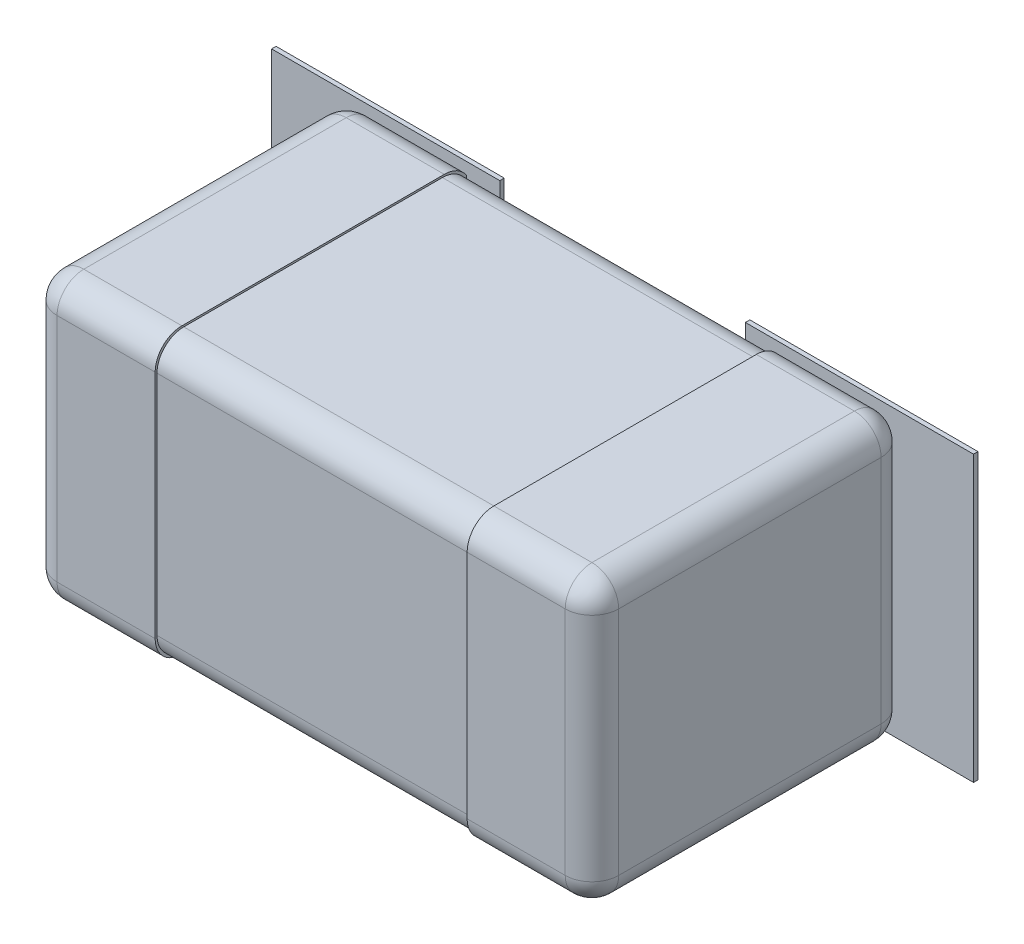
ISO-10303-21;
HEADER;
FILE_DESCRIPTION(('STEP AP214'),'2;1');
FILE_NAME('part.step','',(''),(''),'','','');
FILE_SCHEMA(('AUTOMOTIVE_DESIGN { 1 0 10303 214 1 1 1 1 }'));
ENDSEC;
DATA;
#1=APPLICATION_CONTEXT('core data for automotive mechanical design processes');
#2=APPLICATION_PROTOCOL_DEFINITION('international standard','automotive_design',2000,#1);
#3=PRODUCT_CONTEXT('',#1,'mechanical');
#4=PRODUCT('Part','Part','',(#3));
#5=PRODUCT_RELATED_PRODUCT_CATEGORY('part','',(#4));
#6=PRODUCT_DEFINITION_FORMATION('','',#4);
#7=PRODUCT_DEFINITION_CONTEXT('part definition',#1,'design');
#8=PRODUCT_DEFINITION('design','',#6,#7);
#9=PRODUCT_DEFINITION_SHAPE('','',#8);
#10=(LENGTH_UNIT() NAMED_UNIT(*) SI_UNIT(.MILLI.,.METRE.));
#11=(NAMED_UNIT(*) PLANE_ANGLE_UNIT() SI_UNIT($,.RADIAN.));
#12=(NAMED_UNIT(*) SI_UNIT($,.STERADIAN.) SOLID_ANGLE_UNIT());
#13=UNCERTAINTY_MEASURE_WITH_UNIT(LENGTH_MEASURE(1.E-05),#10,'distance_accuracy_value','');
#14=(GEOMETRIC_REPRESENTATION_CONTEXT(3) GLOBAL_UNCERTAINTY_ASSIGNED_CONTEXT((#13)) GLOBAL_UNIT_ASSIGNED_CONTEXT((#10,
#11,#12)) REPRESENTATION_CONTEXT('',''));
#15=CARTESIAN_POINT('',(0.,0.,0.));
#16=DIRECTION('',(0.,0.,1.));
#17=DIRECTION('',(1.,0.,0.));
#18=AXIS2_PLACEMENT_3D('',#15,#16,#17);
#19=CARTESIAN_POINT('',(0.800000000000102,-0.404999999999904,0.0762));
#20=DIRECTION('',(1.,0.,0.));
#21=DIRECTION('',(0.,0.,-1.));
#22=AXIS2_PLACEMENT_3D('',#19,#20,#21);
#23=PLANE('',#22);
#24=DIRECTION('',(0.,0.,-1.));
#25=VECTOR('',#24,1.);
#26=CARTESIAN_POINT('',(0.800000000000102,0.328799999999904,2.1492603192));
#27=LINE('',#26,#25);
#28=CARTESIAN_POINT('',(0.800000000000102,0.328799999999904,0.899922));
#29=VERTEX_POINT('',#28);
#30=CARTESIAN_POINT('',(0.800000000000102,0.328799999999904,0.152399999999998));
#31=VERTEX_POINT('',#30);
#32=EDGE_CURVE('E149',#29,#31,#27,.T.);
#33=ORIENTED_EDGE('',*,*,#32,.F.);
#34=DIRECTION('',(0.,1.,0.));
#35=VECTOR('',#34,1.);
#36=CARTESIAN_POINT('',(0.800000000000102,-1.4609268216,0.899922));
#37=LINE('',#36,#35);
#38=CARTESIAN_POINT('',(0.800000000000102,-0.328799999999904,0.899922));
#39=VERTEX_POINT('',#38);
#40=EDGE_CURVE('E175',#39,#29,#37,.T.);
#41=ORIENTED_EDGE('',*,*,#40,.F.);
#42=DIRECTION('',(0.,0.,-1.));
#43=VECTOR('',#42,1.);
#44=CARTESIAN_POINT('',(0.800000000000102,-0.328799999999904,2.1492603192));
#45=LINE('',#44,#43);
#46=CARTESIAN_POINT('',(0.800000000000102,-0.328799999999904,0.1524));
#47=VERTEX_POINT('',#46);
#48=EDGE_CURVE('E157',#47,#39,#45,.F.);
#49=ORIENTED_EDGE('',*,*,#48,.F.);
#50=DIRECTION('',(0.,-1.,0.));
#51=VECTOR('',#50,1.);
#52=CARTESIAN_POINT('',(0.800000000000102,1.4609268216,0.1524));
#53=LINE('',#52,#51);
#54=EDGE_CURVE('E162',#31,#47,#53,.T.);
#55=ORIENTED_EDGE('',*,*,#54,.F.);
#56=EDGE_LOOP('',(#33,#41,#49,#55));
#57=FACE_BOUND('',#56,.T.);
#58=ADVANCED_FACE('F16',(#57),#23,.T.);
#59=CARTESIAN_POINT('',(-0.800000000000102,0.404999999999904,0.0762));
#60=DIRECTION('',(-1.,0.,0.));
#61=DIRECTION('',(0.,0.,1.));
#62=AXIS2_PLACEMENT_3D('',#59,#60,#61);
#63=PLANE('',#62);
#64=DIRECTION('',(0.,0.,-1.));
#65=VECTOR('',#64,1.);
#66=CARTESIAN_POINT('',(-0.800000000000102,0.328799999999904,2.1492603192));
#67=LINE('',#66,#65);
#68=CARTESIAN_POINT('',(-0.800000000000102,0.328799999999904,0.1524));
#69=VERTEX_POINT('',#68);
#70=CARTESIAN_POINT('',(-0.800000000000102,0.328799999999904,0.899922));
#71=VERTEX_POINT('',#70);
#72=EDGE_CURVE('E146',#69,#71,#67,.F.);
#73=ORIENTED_EDGE('',*,*,#72,.F.);
#74=DIRECTION('',(0.,1.,0.));
#75=VECTOR('',#74,1.);
#76=CARTESIAN_POINT('',(-0.800000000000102,-1.4609268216,0.1524));
#77=LINE('',#76,#75);
#78=CARTESIAN_POINT('',(-0.800000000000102,-0.328799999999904,0.1524));
#79=VERTEX_POINT('',#78);
#80=EDGE_CURVE('E151',#79,#69,#77,.T.);
#81=ORIENTED_EDGE('',*,*,#80,.F.);
#82=DIRECTION('',(0.,0.,-1.));
#83=VECTOR('',#82,1.);
#84=CARTESIAN_POINT('',(-0.800000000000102,-0.328799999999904,2.1492603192));
#85=LINE('',#84,#83);
#86=CARTESIAN_POINT('',(-0.800000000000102,-0.328799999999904,0.899922));
#87=VERTEX_POINT('',#86);
#88=EDGE_CURVE('E113',#87,#79,#85,.T.);
#89=ORIENTED_EDGE('',*,*,#88,.F.);
#90=DIRECTION('',(0.,-1.,0.));
#91=VECTOR('',#90,1.);
#92=CARTESIAN_POINT('',(-0.800000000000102,1.4609268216,0.899922));
#93=LINE('',#92,#91);
#94=EDGE_CURVE('E132',#71,#87,#93,.T.);
#95=ORIENTED_EDGE('',*,*,#94,.F.);
#96=EDGE_LOOP('',(#73,#81,#89,#95));
#97=FACE_BOUND('',#96,.T.);
#98=ADVANCED_FACE('F466',(#97),#63,.T.);
#99=CARTESIAN_POINT('',(-0.723800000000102,-0.328799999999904,2.1492603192));
#100=DIRECTION('',(0.,0.,-1.));
#101=DIRECTION('',(-1.,0.,0.));
#102=AXIS2_PLACEMENT_3D('',#99,#100,#101);
#103=CYLINDRICAL_SURFACE('',#102,0.0762);
#104=CARTESIAN_POINT('',(-0.723800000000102,-0.328799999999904,0.1524));
#105=DIRECTION('',(0.,0.,-1.));
#106=DIRECTION('',(-1.,0.,0.));
#107=AXIS2_PLACEMENT_3D('',#104,#105,#106);
#108=CIRCLE('',#107,0.0762);
#109=CARTESIAN_POINT('',(-0.723800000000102,-0.404999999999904,0.1524));
#110=VERTEX_POINT('',#109);
#111=EDGE_CURVE('E665',#110,#79,#108,.T.);
#112=ORIENTED_EDGE('',*,*,#111,.F.);
#113=DIRECTION('',(0.,0.,-1.));
#114=VECTOR('',#113,1.);
#115=CARTESIAN_POINT('',(-0.723800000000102,-0.404999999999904,0.0762));
#116=LINE('',#115,#114);
#117=CARTESIAN_POINT('',(-0.723800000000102,-0.404999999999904,0.899921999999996));
#118=VERTEX_POINT('',#117);
#119=EDGE_CURVE('E130',#118,#110,#116,.T.);
#120=ORIENTED_EDGE('',*,*,#119,.F.);
#121=CARTESIAN_POINT('',(-0.723800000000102,-0.328799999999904,0.899922));
#122=DIRECTION('',(1.05637720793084E-13,-1.05637720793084E-13,1.));
#123=DIRECTION('',(-0.707106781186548,-0.707106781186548,0.));
#124=AXIS2_PLACEMENT_3D('',#121,#122,#123);
#125=CIRCLE('',#124,0.0762);
#126=CARTESIAN_POINT('',(-0.777681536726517,-0.382681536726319,0.899922));
#127=VERTEX_POINT('',#126);
#128=EDGE_CURVE('E123',#127,#118,#125,.T.);
#129=ORIENTED_EDGE('',*,*,#128,.F.);
#130=CARTESIAN_POINT('',(-0.723800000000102,-0.328799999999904,0.899922));
#131=DIRECTION('',(0.,0.,-1.));
#132=DIRECTION('',(-1.,0.,0.));
#133=AXIS2_PLACEMENT_3D('',#130,#131,#132);
#134=CIRCLE('',#133,0.0762);
#135=EDGE_CURVE('E19',#87,#127,#134,.F.);
#136=ORIENTED_EDGE('',*,*,#135,.F.);
#137=ORIENTED_EDGE('',*,*,#88,.T.);
#138=EDGE_LOOP('',(#112,#120,#129,#136,#137));
#139=FACE_BOUND('',#138,.T.);
#140=ADVANCED_FACE('F128',(#139),#103,.T.);
#141=CARTESIAN_POINT('',(-0.723800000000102,-0.328799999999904,0.899922));
#142=DIRECTION('',(-0.707106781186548,-0.707106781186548,0.));
#143=DIRECTION('',(0.,0.,1.));
#144=AXIS2_PLACEMENT_3D('',#141,#142,#143);
#145=SPHERICAL_SURFACE('',#144,0.0762);
#146=ORIENTED_EDGE('',*,*,#135,.T.);
#147=ORIENTED_EDGE('',*,*,#128,.T.);
#148=CARTESIAN_POINT('',(-0.723800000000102,-0.328799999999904,0.899922));
#149=DIRECTION('',(1.,0.,0.));
#150=DIRECTION('',(0.,0.,-1.));
#151=AXIS2_PLACEMENT_3D('',#148,#149,#150);
#152=CIRCLE('',#151,0.0762);
#153=CARTESIAN_POINT('',(-0.723800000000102,-0.328799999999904,0.976122));
#154=VERTEX_POINT('',#153);
#155=EDGE_CURVE('E622',#154,#118,#152,.T.);
#156=ORIENTED_EDGE('',*,*,#155,.F.);
#157=CARTESIAN_POINT('',(-0.723800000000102,-0.328799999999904,0.899922));
#158=DIRECTION('',(0.,-1.,0.));
#159=DIRECTION('',(0.,0.,-1.));
#160=AXIS2_PLACEMENT_3D('',#157,#158,#159);
#161=CIRCLE('',#160,0.0762);
#162=EDGE_CURVE('E125',#87,#154,#161,.F.);
#163=ORIENTED_EDGE('',*,*,#162,.F.);
#164=EDGE_LOOP('',(#146,#147,#156,#163));
#165=FACE_BOUND('',#164,.T.);
#166=ADVANCED_FACE('F121',(#165),#145,.T.);
#167=CARTESIAN_POINT('',(-0.723800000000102,1.4609268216,0.899922));
#168=DIRECTION('',(0.,-1.,0.));
#169=DIRECTION('',(0.,0.,-1.));
#170=AXIS2_PLACEMENT_3D('',#167,#168,#169);
#171=CYLINDRICAL_SURFACE('',#170,0.0762);
#172=ORIENTED_EDGE('',*,*,#162,.T.);
#173=DIRECTION('',(0.,1.,0.));
#174=VECTOR('',#173,1.);
#175=CARTESIAN_POINT('',(-0.723800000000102,0.,0.976122));
#176=LINE('',#175,#174);
#177=CARTESIAN_POINT('',(-0.723800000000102,0.328799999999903,0.976122));
#178=VERTEX_POINT('',#177);
#179=EDGE_CURVE('E445',#178,#154,#176,.F.);
#180=ORIENTED_EDGE('',*,*,#179,.F.);
#181=CARTESIAN_POINT('',(-0.723800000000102,0.328799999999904,0.899922));
#182=DIRECTION('',(0.,1.,0.));
#183=DIRECTION('',(-0.707106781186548,0.,0.707106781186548));
#184=AXIS2_PLACEMENT_3D('',#181,#182,#183);
#185=CIRCLE('',#184,0.0762);
#186=CARTESIAN_POINT('',(-0.777681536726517,0.328799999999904,0.953803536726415));
#187=VERTEX_POINT('',#186);
#188=EDGE_CURVE('E452',#187,#178,#185,.T.);
#189=ORIENTED_EDGE('',*,*,#188,.F.);
#190=CARTESIAN_POINT('',(-0.723800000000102,0.328799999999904,0.899922));
#191=DIRECTION('',(0.,-1.,0.));
#192=DIRECTION('',(0.,0.,-1.));
#193=AXIS2_PLACEMENT_3D('',#190,#191,#192);
#194=CIRCLE('',#193,0.0762);
#195=EDGE_CURVE('E919',#71,#187,#194,.F.);
#196=ORIENTED_EDGE('',*,*,#195,.F.);
#197=ORIENTED_EDGE('',*,*,#94,.T.);
#198=EDGE_LOOP('',(#172,#180,#189,#196,#197));
#199=FACE_BOUND('',#198,.T.);
#200=ADVANCED_FACE('F458',(#199),#171,.T.);
#201=CARTESIAN_POINT('',(-0.723800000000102,0.328799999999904,0.899922));
#202=DIRECTION('',(-0.707106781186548,0.,0.707106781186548));
#203=DIRECTION('',(0.,1.,0.));
#204=AXIS2_PLACEMENT_3D('',#201,#202,#203);
#205=SPHERICAL_SURFACE('',#204,0.0762);
#206=ORIENTED_EDGE('',*,*,#195,.T.);
#207=ORIENTED_EDGE('',*,*,#188,.T.);
#208=CARTESIAN_POINT('',(-0.723800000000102,0.328799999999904,0.899922));
#209=DIRECTION('',(-1.,0.,0.));
#210=DIRECTION('',(0.,0.,1.));
#211=AXIS2_PLACEMENT_3D('',#208,#209,#210);
#212=CIRCLE('',#211,0.0762);
#213=CARTESIAN_POINT('',(-0.723800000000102,0.404999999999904,0.899922));
#214=VERTEX_POINT('',#213);
#215=EDGE_CURVE('E617',#214,#178,#212,.F.);
#216=ORIENTED_EDGE('',*,*,#215,.F.);
#217=CARTESIAN_POINT('',(-0.723800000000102,0.328799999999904,0.899922));
#218=DIRECTION('',(0.,0.,-1.));
#219=DIRECTION('',(-1.,0.,0.));
#220=AXIS2_PLACEMENT_3D('',#217,#218,#219);
#221=CIRCLE('',#220,0.0762);
#222=EDGE_CURVE('E150',#71,#214,#221,.T.);
#223=ORIENTED_EDGE('',*,*,#222,.F.);
#224=EDGE_LOOP('',(#206,#207,#216,#223));
#225=FACE_BOUND('',#224,.T.);
#226=ADVANCED_FACE('F454',(#225),#205,.T.);
#227=CARTESIAN_POINT('',(-0.723800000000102,0.328799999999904,2.1492603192));
#228=DIRECTION('',(0.,0.,-1.));
#229=DIRECTION('',(-1.,0.,0.));
#230=AXIS2_PLACEMENT_3D('',#227,#228,#229);
#231=CYLINDRICAL_SURFACE('',#230,0.0762);
#232=CARTESIAN_POINT('',(-0.723800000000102,0.328799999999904,0.1524));
#233=DIRECTION('',(0.,0.,-1.));
#234=DIRECTION('',(-1.,0.,0.));
#235=AXIS2_PLACEMENT_3D('',#232,#233,#234);
#236=CIRCLE('',#235,0.0762);
#237=CARTESIAN_POINT('',(-0.777681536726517,0.382681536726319,0.1524));
#238=VERTEX_POINT('',#237);
#239=EDGE_CURVE('E663',#69,#238,#236,.T.);
#240=ORIENTED_EDGE('',*,*,#239,.F.);
#241=ORIENTED_EDGE('',*,*,#72,.T.);
#242=ORIENTED_EDGE('',*,*,#222,.T.);
#243=DIRECTION('',(0.,0.,1.));
#244=VECTOR('',#243,1.);
#245=CARTESIAN_POINT('',(-0.723800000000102,0.404999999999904,0.0762));
#246=LINE('',#245,#244);
#247=CARTESIAN_POINT('',(-0.723800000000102,0.404999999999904,0.1524));
#248=VERTEX_POINT('',#247);
#249=EDGE_CURVE('E440',#248,#214,#246,.T.);
#250=ORIENTED_EDGE('',*,*,#249,.F.);
#251=CARTESIAN_POINT('',(-0.723800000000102,0.328799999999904,0.1524));
#252=DIRECTION('',(0.,0.,-1.));
#253=DIRECTION('',(-0.707106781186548,0.707106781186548,0.));
#254=AXIS2_PLACEMENT_3D('',#251,#252,#253);
#255=CIRCLE('',#254,0.0762);
#256=EDGE_CURVE('E387',#238,#248,#255,.T.);
#257=ORIENTED_EDGE('',*,*,#256,.F.);
#258=EDGE_LOOP('',(#240,#241,#242,#250,#257));
#259=FACE_BOUND('',#258,.T.);
#260=ADVANCED_FACE('F457',(#259),#231,.T.);
#261=CARTESIAN_POINT('',(0.723800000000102,0.328799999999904,2.1492603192));
#262=DIRECTION('',(0.,0.,-1.));
#263=DIRECTION('',(-1.,0.,0.));
#264=AXIS2_PLACEMENT_3D('',#261,#262,#263);
#265=CYLINDRICAL_SURFACE('',#264,0.0762);
#266=CARTESIAN_POINT('',(0.723800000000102,0.328799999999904,0.1524));
#267=DIRECTION('',(0.,0.,-1.));
#268=DIRECTION('',(-1.,0.,0.));
#269=AXIS2_PLACEMENT_3D('',#266,#267,#268);
#270=CIRCLE('',#269,0.0762);
#271=CARTESIAN_POINT('',(0.723800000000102,0.404999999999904,0.1524));
#272=VERTEX_POINT('',#271);
#273=CARTESIAN_POINT('',(0.777681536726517,0.382681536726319,0.1524));
#274=VERTEX_POINT('',#273);
#275=EDGE_CURVE('E324',#272,#274,#270,.T.);
#276=ORIENTED_EDGE('',*,*,#275,.F.);
#277=DIRECTION('',(0.,0.,1.));
#278=VECTOR('',#277,1.);
#279=CARTESIAN_POINT('',(0.723800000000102,0.404999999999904,0.0762));
#280=LINE('',#279,#278);
#281=CARTESIAN_POINT('',(0.723800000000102,0.404999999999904,0.899922));
#282=VERTEX_POINT('',#281);
#283=EDGE_CURVE('E439',#282,#272,#280,.F.);
#284=ORIENTED_EDGE('',*,*,#283,.F.);
#285=CARTESIAN_POINT('',(0.723800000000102,0.328799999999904,0.899922));
#286=DIRECTION('',(0.,0.,-1.));
#287=DIRECTION('',(-1.,0.,0.));
#288=AXIS2_PLACEMENT_3D('',#285,#286,#287);
#289=CIRCLE('',#288,0.0762);
#290=EDGE_CURVE('E167',#29,#282,#289,.F.);
#291=ORIENTED_EDGE('',*,*,#290,.F.);
#292=ORIENTED_EDGE('',*,*,#32,.T.);
#293=CARTESIAN_POINT('',(0.723800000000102,0.328799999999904,0.1524));
#294=DIRECTION('',(0.,0.,-1.));
#295=DIRECTION('',(0.707106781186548,0.707106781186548,0.));
#296=AXIS2_PLACEMENT_3D('',#293,#294,#295);
#297=CIRCLE('',#296,0.0762);
#298=EDGE_CURVE('E321',#274,#31,#297,.T.);
#299=ORIENTED_EDGE('',*,*,#298,.F.);
#300=EDGE_LOOP('',(#276,#284,#291,#292,#299));
#301=FACE_BOUND('',#300,.T.);
#302=ADVANCED_FACE('F433',(#301),#265,.T.);
#303=CARTESIAN_POINT('',(0.723800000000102,0.328799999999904,0.899922));
#304=DIRECTION('',(0.,0.707106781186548,0.707106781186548));
#305=DIRECTION('',(1.,0.,0.));
#306=AXIS2_PLACEMENT_3D('',#303,#304,#305);
#307=SPHERICAL_SURFACE('',#306,0.0762);
#308=CARTESIAN_POINT('',(0.723800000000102,0.328799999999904,0.899922));
#309=DIRECTION('',(0.,1.,0.));
#310=DIRECTION('',(0.,0.,1.));
#311=AXIS2_PLACEMENT_3D('',#308,#309,#310);
#312=CIRCLE('',#311,0.0762);
#313=CARTESIAN_POINT('',(0.723800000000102,0.328799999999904,0.976122));
#314=VERTEX_POINT('',#313);
#315=EDGE_CURVE('E178',#29,#314,#312,.F.);
#316=ORIENTED_EDGE('',*,*,#315,.F.);
#317=ORIENTED_EDGE('',*,*,#290,.T.);
#318=CARTESIAN_POINT('',(0.723800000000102,0.328799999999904,0.899922));
#319=DIRECTION('',(-1.,0.,0.));
#320=DIRECTION('',(0.,0.,1.));
#321=AXIS2_PLACEMENT_3D('',#318,#319,#320);
#322=CIRCLE('',#321,0.0762);
#323=CARTESIAN_POINT('',(0.723800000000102,0.382681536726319,0.953803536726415));
#324=VERTEX_POINT('',#323);
#325=EDGE_CURVE('E588',#324,#282,#322,.T.);
#326=ORIENTED_EDGE('',*,*,#325,.F.);
#327=CARTESIAN_POINT('',(0.723800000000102,0.328799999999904,0.899922));
#328=DIRECTION('',(-1.,0.,0.));
#329=DIRECTION('',(0.,0.,1.));
#330=AXIS2_PLACEMENT_3D('',#327,#328,#329);
#331=CIRCLE('',#330,0.0762);
#332=EDGE_CURVE('E592',#314,#324,#331,.T.);
#333=ORIENTED_EDGE('',*,*,#332,.F.);
#334=EDGE_LOOP('',(#316,#317,#326,#333));
#335=FACE_BOUND('',#334,.T.);
#336=ADVANCED_FACE('F428',(#335),#307,.T.);
#337=CARTESIAN_POINT('',(0.723800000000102,-1.4609268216,0.899922));
#338=DIRECTION('',(0.,1.,0.));
#339=DIRECTION('',(0.,0.,1.));
#340=AXIS2_PLACEMENT_3D('',#337,#338,#339);
#341=CYLINDRICAL_SURFACE('',#340,0.0762);
#342=CARTESIAN_POINT('',(0.723800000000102,-0.328799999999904,0.899922));
#343=DIRECTION('',(0.,1.,0.));
#344=DIRECTION('',(0.,0.,1.));
#345=AXIS2_PLACEMENT_3D('',#342,#343,#344);
#346=CIRCLE('',#345,0.0762);
#347=CARTESIAN_POINT('',(0.777681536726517,-0.328799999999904,0.953803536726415));
#348=VERTEX_POINT('',#347);
#349=EDGE_CURVE('E177',#39,#348,#346,.F.);
#350=ORIENTED_EDGE('',*,*,#349,.F.);
#351=ORIENTED_EDGE('',*,*,#40,.T.);
#352=ORIENTED_EDGE('',*,*,#315,.T.);
#353=DIRECTION('',(0.,1.,0.));
#354=VECTOR('',#353,1.);
#355=CARTESIAN_POINT('',(0.723800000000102,0.,0.976122));
#356=LINE('',#355,#354);
#357=CARTESIAN_POINT('',(0.723800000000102,-0.328799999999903,0.976122));
#358=VERTEX_POINT('',#357);
#359=EDGE_CURVE('E408',#358,#314,#356,.T.);
#360=ORIENTED_EDGE('',*,*,#359,.F.);
#361=CARTESIAN_POINT('',(0.723800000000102,-0.328799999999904,0.899922));
#362=DIRECTION('',(0.,-1.,0.));
#363=DIRECTION('',(0.707106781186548,0.,0.707106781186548));
#364=AXIS2_PLACEMENT_3D('',#361,#362,#363);
#365=CIRCLE('',#364,0.0762);
#366=EDGE_CURVE('E415',#348,#358,#365,.T.);
#367=ORIENTED_EDGE('',*,*,#366,.F.);
#368=EDGE_LOOP('',(#350,#351,#352,#360,#367));
#369=FACE_BOUND('',#368,.T.);
#370=ADVANCED_FACE('F423',(#369),#341,.T.);
#371=CARTESIAN_POINT('',(0.723800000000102,-0.328799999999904,0.899922));
#372=DIRECTION('',(0.707106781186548,0.,0.707106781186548));
#373=DIRECTION('',(0.,-1.,0.));
#374=AXIS2_PLACEMENT_3D('',#371,#372,#373);
#375=SPHERICAL_SURFACE('',#374,0.0762);
#376=ORIENTED_EDGE('',*,*,#366,.T.);
#377=CARTESIAN_POINT('',(0.723800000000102,-0.328799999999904,0.899922));
#378=DIRECTION('',(1.,0.,0.));
#379=DIRECTION('',(0.,0.,-1.));
#380=AXIS2_PLACEMENT_3D('',#377,#378,#379);
#381=CIRCLE('',#380,0.0762);
#382=CARTESIAN_POINT('',(0.723800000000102,-0.404999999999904,0.899922));
#383=VERTEX_POINT('',#382);
#384=EDGE_CURVE('E411',#383,#358,#381,.F.);
#385=ORIENTED_EDGE('',*,*,#384,.F.);
#386=CARTESIAN_POINT('',(0.723800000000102,-0.328799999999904,0.899922));
#387=DIRECTION('',(0.,0.,-1.));
#388=DIRECTION('',(-1.,0.,0.));
#389=AXIS2_PLACEMENT_3D('',#386,#387,#388);
#390=CIRCLE('',#389,0.0762);
#391=EDGE_CURVE('E161',#39,#383,#390,.T.);
#392=ORIENTED_EDGE('',*,*,#391,.F.);
#393=ORIENTED_EDGE('',*,*,#349,.T.);
#394=EDGE_LOOP('',(#376,#385,#392,#393));
#395=FACE_BOUND('',#394,.T.);
#396=ADVANCED_FACE('F418',(#395),#375,.T.);
#397=CARTESIAN_POINT('',(0.723800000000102,-0.328799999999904,2.1492603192));
#398=DIRECTION('',(0.,0.,-1.));
#399=DIRECTION('',(-1.,0.,0.));
#400=AXIS2_PLACEMENT_3D('',#397,#398,#399);
#401=CYLINDRICAL_SURFACE('',#400,0.0762);
#402=CARTESIAN_POINT('',(0.723800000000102,-0.328799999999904,0.1524));
#403=DIRECTION('',(0.,0.,-1.));
#404=DIRECTION('',(-1.,0.,0.));
#405=AXIS2_PLACEMENT_3D('',#402,#403,#404);
#406=CIRCLE('',#405,0.0762);
#407=CARTESIAN_POINT('',(0.777681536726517,-0.382681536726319,0.1524));
#408=VERTEX_POINT('',#407);
#409=EDGE_CURVE('E908',#47,#408,#406,.T.);
#410=ORIENTED_EDGE('',*,*,#409,.F.);
#411=ORIENTED_EDGE('',*,*,#48,.T.);
#412=ORIENTED_EDGE('',*,*,#391,.T.);
#413=DIRECTION('',(0.,0.,-1.));
#414=VECTOR('',#413,1.);
#415=CARTESIAN_POINT('',(0.723800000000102,-0.404999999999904,0.0762));
#416=LINE('',#415,#414);
#417=CARTESIAN_POINT('',(0.723800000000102,-0.404999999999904,0.1524));
#418=VERTEX_POINT('',#417);
#419=EDGE_CURVE('E403',#418,#383,#416,.F.);
#420=ORIENTED_EDGE('',*,*,#419,.F.);
#421=CARTESIAN_POINT('',(0.723800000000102,-0.328799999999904,0.1524));
#422=DIRECTION('',(0.,0.,-1.));
#423=DIRECTION('',(0.707106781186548,-0.707106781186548,0.));
#424=AXIS2_PLACEMENT_3D('',#421,#422,#423);
#425=CIRCLE('',#424,0.0762);
#426=EDGE_CURVE('E319',#408,#418,#425,.T.);
#427=ORIENTED_EDGE('',*,*,#426,.F.);
#428=EDGE_LOOP('',(#410,#411,#412,#420,#427));
#429=FACE_BOUND('',#428,.T.);
#430=ADVANCED_FACE('F422',(#429),#401,.T.);
#431=CARTESIAN_POINT('',(0.,0.,0.0762));
#432=DIRECTION('',(0.,0.,1.));
#433=DIRECTION('',(1.,0.,0.));
#434=AXIS2_PLACEMENT_3D('',#431,#432,#433);
#435=PLANE('',#434);
#436=DIRECTION('',(1.,0.,0.));
#437=VECTOR('',#436,1.);
#438=CARTESIAN_POINT('',(-0.999871,-0.405003,0.0762));
#439=LINE('',#438,#437);
#440=CARTESIAN_POINT('',(-0.999871,-0.405003,0.0762));
#441=VERTEX_POINT('',#440);
#442=CARTESIAN_POINT('',(-0.349885,-0.405003,0.0762));
#443=VERTEX_POINT('',#442);
#444=EDGE_CURVE('E397',#441,#443,#439,.T.);
#445=ORIENTED_EDGE('',*,*,#444,.F.);
#446=DIRECTION('',(0.,1.,0.));
#447=VECTOR('',#446,1.);
#448=CARTESIAN_POINT('',(-0.999871,0.405003,0.0762));
#449=LINE('',#448,#447);
#450=CARTESIAN_POINT('',(-0.999871,0.405003,0.0762));
#451=VERTEX_POINT('',#450);
#452=EDGE_CURVE('E139',#451,#441,#449,.F.);
#453=ORIENTED_EDGE('',*,*,#452,.F.);
#454=DIRECTION('',(1.,0.,0.));
#455=VECTOR('',#454,1.);
#456=CARTESIAN_POINT('',(-0.349885,0.405003,0.0762));
#457=LINE('',#456,#455);
#458=CARTESIAN_POINT('',(-0.349885,0.405003,0.0762));
#459=VERTEX_POINT('',#458);
#460=EDGE_CURVE('E384',#459,#451,#457,.F.);
#461=ORIENTED_EDGE('',*,*,#460,.F.);
#462=DIRECTION('',(0.,1.,0.));
#463=VECTOR('',#462,1.);
#464=CARTESIAN_POINT('',(-0.349885,-0.405003,0.0762));
#465=LINE('',#464,#463);
#466=EDGE_CURVE('E390',#443,#459,#465,.T.);
#467=ORIENTED_EDGE('',*,*,#466,.F.);
#468=EDGE_LOOP('',(#445,#453,#461,#467));
#469=FACE_BOUND('',#468,.T.);
#470=ADVANCED_FACE('F976',(#469),#435,.F.);
#471=CARTESIAN_POINT('',(0.,0.,0.0762));
#472=DIRECTION('',(0.,0.,1.));
#473=DIRECTION('',(1.,0.,0.));
#474=AXIS2_PLACEMENT_3D('',#471,#472,#473);
#475=PLANE('',#474);
#476=DIRECTION('',(1.,0.,0.));
#477=VECTOR('',#476,1.);
#478=CARTESIAN_POINT('',(0.349885,-0.405003,0.0762));
#479=LINE('',#478,#477);
#480=CARTESIAN_POINT('',(0.349885,-0.405003,0.0762));
#481=VERTEX_POINT('',#480);
#482=CARTESIAN_POINT('',(0.999871,-0.405003,0.0762));
#483=VERTEX_POINT('',#482);
#484=EDGE_CURVE('E160',#481,#483,#479,.T.);
#485=ORIENTED_EDGE('',*,*,#484,.F.);
#486=DIRECTION('',(0.,1.,0.));
#487=VECTOR('',#486,1.);
#488=CARTESIAN_POINT('',(0.349885,0.405003,0.0762));
#489=LINE('',#488,#487);
#490=CARTESIAN_POINT('',(0.349885,0.405003,0.0762));
#491=VERTEX_POINT('',#490);
#492=EDGE_CURVE('E335',#491,#481,#489,.F.);
#493=ORIENTED_EDGE('',*,*,#492,.F.);
#494=DIRECTION('',(1.,0.,0.));
#495=VECTOR('',#494,1.);
#496=CARTESIAN_POINT('',(0.999871,0.405003,0.0762));
#497=LINE('',#496,#495);
#498=CARTESIAN_POINT('',(0.999871,0.405003,0.0762));
#499=VERTEX_POINT('',#498);
#500=EDGE_CURVE('E345',#499,#491,#497,.F.);
#501=ORIENTED_EDGE('',*,*,#500,.F.);
#502=DIRECTION('',(0.,1.,0.));
#503=VECTOR('',#502,1.);
#504=CARTESIAN_POINT('',(0.999871,-0.405003,0.0762));
#505=LINE('',#504,#503);
#506=EDGE_CURVE('E168',#483,#499,#505,.T.);
#507=ORIENTED_EDGE('',*,*,#506,.F.);
#508=EDGE_LOOP('',(#485,#493,#501,#507));
#509=FACE_BOUND('',#508,.T.);
#510=ADVANCED_FACE('F980',(#509),#475,.F.);
#511=CARTESIAN_POINT('',(0.349885,-0.405003,0.0762));
#512=DIRECTION('',(0.,-1.,0.));
#513=DIRECTION('',(0.,0.,-1.));
#514=AXIS2_PLACEMENT_3D('',#511,#512,#513);
#515=PLANE('',#514);
#516=DIRECTION('',(0.,0.,1.));
#517=VECTOR('',#516,1.);
#518=CARTESIAN_POINT('',(0.349885,-0.405003,0.0762));
#519=LINE('',#518,#517);
#520=CARTESIAN_POINT('',(0.349885,-0.405003,0.0889));
#521=VERTEX_POINT('',#520);
#522=EDGE_CURVE('E362',#481,#521,#519,.T.);
#523=ORIENTED_EDGE('',*,*,#522,.F.);
#524=ORIENTED_EDGE('',*,*,#484,.T.);
#525=DIRECTION('',(0.,0.,-1.));
#526=VECTOR('',#525,1.);
#527=CARTESIAN_POINT('',(0.999871,-0.405003,0.0762));
#528=LINE('',#527,#526);
#529=CARTESIAN_POINT('',(0.999871,-0.405003,0.0889));
#530=VERTEX_POINT('',#529);
#531=EDGE_CURVE('E172',#530,#483,#528,.T.);
#532=ORIENTED_EDGE('',*,*,#531,.F.);
#533=DIRECTION('',(1.,0.,0.));
#534=VECTOR('',#533,1.);
#535=CARTESIAN_POINT('',(0.,-0.405003,0.0889));
#536=LINE('',#535,#534);
#537=EDGE_CURVE('E350',#521,#530,#536,.T.);
#538=ORIENTED_EDGE('',*,*,#537,.F.);
#539=EDGE_LOOP('',(#523,#524,#532,#538));
#540=FACE_BOUND('',#539,.T.);
#541=ADVANCED_FACE('F985',(#540),#515,.T.);
#542=CARTESIAN_POINT('',(0.999871,-0.405003,0.0762));
#543=DIRECTION('',(1.,0.,0.));
#544=DIRECTION('',(0.,0.,-1.));
#545=AXIS2_PLACEMENT_3D('',#542,#543,#544);
#546=PLANE('',#545);
#547=ORIENTED_EDGE('',*,*,#531,.T.);
#548=ORIENTED_EDGE('',*,*,#506,.T.);
#549=DIRECTION('',(0.,0.,1.));
#550=VECTOR('',#549,1.);
#551=CARTESIAN_POINT('',(0.999871,0.405003,0.0762));
#552=LINE('',#551,#550);
#553=CARTESIAN_POINT('',(0.999871,0.405003,0.0889));
#554=VERTEX_POINT('',#553);
#555=EDGE_CURVE('E171',#554,#499,#552,.F.);
#556=ORIENTED_EDGE('',*,*,#555,.F.);
#557=DIRECTION('',(0.,1.,0.));
#558=VECTOR('',#557,1.);
#559=CARTESIAN_POINT('',(0.999871,0.,0.0889));
#560=LINE('',#559,#558);
#561=EDGE_CURVE('E340',#530,#554,#560,.T.);
#562=ORIENTED_EDGE('',*,*,#561,.F.);
#563=EDGE_LOOP('',(#547,#548,#556,#562));
#564=FACE_BOUND('',#563,.T.);
#565=ADVANCED_FACE('F990',(#564),#546,.T.);
#566=CARTESIAN_POINT('',(0.999871,0.405003,0.0762));
#567=DIRECTION('',(0.,1.,0.));
#568=DIRECTION('',(0.,0.,1.));
#569=AXIS2_PLACEMENT_3D('',#566,#567,#568);
#570=PLANE('',#569);
#571=ORIENTED_EDGE('',*,*,#555,.T.);
#572=ORIENTED_EDGE('',*,*,#500,.T.);
#573=DIRECTION('',(0.,0.,1.));
#574=VECTOR('',#573,1.);
#575=CARTESIAN_POINT('',(0.349885,0.405003,0.0762));
#576=LINE('',#575,#574);
#577=CARTESIAN_POINT('',(0.349885,0.405003,0.0889));
#578=VERTEX_POINT('',#577);
#579=EDGE_CURVE('E332',#578,#491,#576,.F.);
#580=ORIENTED_EDGE('',*,*,#579,.F.);
#581=DIRECTION('',(1.,0.,0.));
#582=VECTOR('',#581,1.);
#583=CARTESIAN_POINT('',(0.,0.405003,0.0889));
#584=LINE('',#583,#582);
#585=EDGE_CURVE('E329',#554,#578,#584,.F.);
#586=ORIENTED_EDGE('',*,*,#585,.F.);
#587=EDGE_LOOP('',(#571,#572,#580,#586));
#588=FACE_BOUND('',#587,.T.);
#589=ADVANCED_FACE('F313',(#588),#570,.T.);
#590=CARTESIAN_POINT('',(0.723800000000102,0.328799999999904,0.1524));
#591=DIRECTION('',(0.707106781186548,0.707106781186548,0.));
#592=DIRECTION('',(0.,0.,-1.));
#593=AXIS2_PLACEMENT_3D('',#590,#591,#592);
#594=SPHERICAL_SURFACE('',#593,0.0762);
#595=CARTESIAN_POINT('',(0.723800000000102,0.328799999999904,0.1524));
#596=DIRECTION('',(0.,-1.,0.));
#597=DIRECTION('',(0.,0.,-1.));
#598=AXIS2_PLACEMENT_3D('',#595,#596,#597);
#599=CIRCLE('',#598,0.0762);
#600=CARTESIAN_POINT('',(0.765921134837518,0.328799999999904,0.0889));
#601=VERTEX_POINT('',#600);
#602=EDGE_CURVE('E165',#601,#31,#599,.T.);
#603=ORIENTED_EDGE('',*,*,#602,.F.);
#604=CARTESIAN_POINT('',(0.723800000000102,0.370921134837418,0.0889));
#605=CARTESIAN_POINT('',(0.72854767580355,0.370952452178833,0.0888999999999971));
#606=CARTESIAN_POINT('',(0.733275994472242,0.370123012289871,0.0889000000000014));
#607=CARTESIAN_POINT('',(0.742208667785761,0.366970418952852,0.0889000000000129));
#608=CARTESIAN_POINT('',(0.746413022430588,0.364647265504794,0.0889000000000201));
#609=CARTESIAN_POINT('',(0.753812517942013,0.358735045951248,0.088900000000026));
#610=CARTESIAN_POINT('',(0.757007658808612,0.355145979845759,0.0889000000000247));
#611=CARTESIAN_POINT('',(0.762025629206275,0.34710875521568,0.0889000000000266));
#612=CARTESIAN_POINT('',(0.76384845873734,0.342660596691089,0.0889000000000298));
#613=CARTESIAN_POINT('',(0.765581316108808,0.335011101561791,0.088900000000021));
#614=CARTESIAN_POINT('',(0.765932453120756,0.331903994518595,0.0889000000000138));
#615=CARTESIAN_POINT('',(0.765921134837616,0.328799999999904,0.0889));
#616=B_SPLINE_CURVE_WITH_KNOTS('',3,(#604,#605,#606,#607,#608,#609,#610,#611,#612,#613,#614,
#615),.UNSPECIFIED.,.F.,.F.,(4,2,2,2,2,4),(0.,0.0141430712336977,0.028286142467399,
0.0424292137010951,0.0565722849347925,0.0658755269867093),.UNSPECIFIED.);
#617=CARTESIAN_POINT('',(0.723800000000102,0.370921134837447,0.0889));
#618=VERTEX_POINT('',#617);
#619=EDGE_CURVE('E296',#618,#601,#616,.T.);
#620=ORIENTED_EDGE('',*,*,#619,.F.);
#621=CARTESIAN_POINT('',(0.723800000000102,0.328799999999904,0.1524));
#622=DIRECTION('',(1.,0.,0.));
#623=DIRECTION('',(0.,0.,-1.));
#624=AXIS2_PLACEMENT_3D('',#621,#622,#623);
#625=CIRCLE('',#624,0.0762);
#626=EDGE_CURVE('E598',#272,#618,#625,.F.);
#627=ORIENTED_EDGE('',*,*,#626,.F.);
#628=ORIENTED_EDGE('',*,*,#275,.T.);
#629=ORIENTED_EDGE('',*,*,#298,.T.);
#630=EDGE_LOOP('',(#603,#620,#627,#628,#629));
#631=FACE_BOUND('',#630,.T.);
#632=ADVANCED_FACE('F306',(#631),#594,.T.);
#633=CARTESIAN_POINT('',(0.723800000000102,1.4609268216,0.1524));
#634=DIRECTION('',(0.,-1.,0.));
#635=DIRECTION('',(0.,0.,-1.));
#636=AXIS2_PLACEMENT_3D('',#633,#634,#635);
#637=CYLINDRICAL_SURFACE('',#636,0.0762);
#638=CARTESIAN_POINT('',(0.723800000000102,-0.328799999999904,0.1524));
#639=DIRECTION('',(0.,-1.,0.));
#640=DIRECTION('',(0.,0.,-1.));
#641=AXIS2_PLACEMENT_3D('',#638,#639,#640);
#642=CIRCLE('',#641,0.0762);
#643=CARTESIAN_POINT('',(0.765921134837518,-0.328799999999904,0.0889));
#644=VERTEX_POINT('',#643);
#645=EDGE_CURVE('E164',#644,#47,#642,.T.);
#646=ORIENTED_EDGE('',*,*,#645,.F.);
#647=DIRECTION('',(0.,1.,0.));
#648=VECTOR('',#647,1.);
#649=CARTESIAN_POINT('',(0.76592113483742,0.,0.0889));
#650=LINE('',#649,#648);
#651=EDGE_CURVE('E302',#601,#644,#650,.F.);
#652=ORIENTED_EDGE('',*,*,#651,.F.);
#653=ORIENTED_EDGE('',*,*,#602,.T.);
#654=ORIENTED_EDGE('',*,*,#54,.T.);
#655=EDGE_LOOP('',(#646,#652,#653,#654));
#656=FACE_BOUND('',#655,.T.);
#657=ADVANCED_FACE('F312',(#656),#637,.T.);
#658=CARTESIAN_POINT('',(0.723800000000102,-0.328799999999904,0.1524));
#659=DIRECTION('',(0.707106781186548,-0.707106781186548,0.));
#660=DIRECTION('',(0.,0.,-1.));
#661=AXIS2_PLACEMENT_3D('',#658,#659,#660);
#662=SPHERICAL_SURFACE('',#661,0.0762);
#663=CARTESIAN_POINT('',(0.723800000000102,-0.328799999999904,0.1524));
#664=DIRECTION('',(-1.,0.,0.));
#665=DIRECTION('',(0.,0.,1.));
#666=AXIS2_PLACEMENT_3D('',#663,#664,#665);
#667=CIRCLE('',#666,0.0762);
#668=CARTESIAN_POINT('',(0.723800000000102,-0.370921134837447,0.0889));
#669=VERTEX_POINT('',#668);
#670=EDGE_CURVE('E578',#669,#418,#667,.T.);
#671=ORIENTED_EDGE('',*,*,#670,.F.);
#672=CARTESIAN_POINT('',(0.765921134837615,-0.328799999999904,0.0889));
#673=CARTESIAN_POINT('',(0.765952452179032,-0.333547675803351,0.0888999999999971));
#674=CARTESIAN_POINT('',(0.765123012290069,-0.338275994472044,0.0889000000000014));
#675=CARTESIAN_POINT('',(0.76197041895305,-0.347208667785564,0.0889000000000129));
#676=CARTESIAN_POINT('',(0.759647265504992,-0.35141302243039,0.0889000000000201));
#677=CARTESIAN_POINT('',(0.753735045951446,-0.358812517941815,0.088900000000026));
#678=CARTESIAN_POINT('',(0.750145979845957,-0.362007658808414,0.0889000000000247));
#679=CARTESIAN_POINT('',(0.742108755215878,-0.367025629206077,0.0889000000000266));
#680=CARTESIAN_POINT('',(0.737660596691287,-0.368848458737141,0.0889000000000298));
#681=CARTESIAN_POINT('',(0.730011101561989,-0.37058131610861,0.088900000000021));
#682=CARTESIAN_POINT('',(0.726903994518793,-0.370932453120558,0.0889000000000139));
#683=CARTESIAN_POINT('',(0.723800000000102,-0.370921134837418,0.0889));
#684=B_SPLINE_CURVE_WITH_KNOTS('',3,(#672,#673,#674,#675,#676,#677,#678,#679,#680,#681,#682,
#683),.UNSPECIFIED.,.F.,.F.,(4,2,2,2,2,4),(0.,0.0141430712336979,0.0282861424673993,
0.0424292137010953,0.0565722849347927,0.0658755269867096),.UNSPECIFIED.);
#685=EDGE_CURVE('E290',#644,#669,#684,.T.);
#686=ORIENTED_EDGE('',*,*,#685,.F.);
#687=ORIENTED_EDGE('',*,*,#645,.T.);
#688=ORIENTED_EDGE('',*,*,#409,.T.);
#689=ORIENTED_EDGE('',*,*,#426,.T.);
#690=EDGE_LOOP('',(#671,#686,#687,#688,#689));
#691=FACE_BOUND('',#690,.T.);
#692=ADVANCED_FACE('F672',(#691),#662,.T.);
#693=CARTESIAN_POINT('',(-0.723800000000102,-0.328799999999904,0.1524));
#694=DIRECTION('',(-0.707106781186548,0.,-0.707106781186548));
#695=DIRECTION('',(0.,-1.,0.));
#696=AXIS2_PLACEMENT_3D('',#693,#694,#695);
#697=SPHERICAL_SURFACE('',#696,0.0762);
#698=CARTESIAN_POINT('',(-0.723800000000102,-0.328799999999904,0.1524));
#699=DIRECTION('',(0.,1.,0.));
#700=DIRECTION('',(0.,0.,1.));
#701=AXIS2_PLACEMENT_3D('',#698,#699,#700);
#702=CIRCLE('',#701,0.0762);
#703=CARTESIAN_POINT('',(-0.765921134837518,-0.328799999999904,0.0889));
#704=VERTEX_POINT('',#703);
#705=CARTESIAN_POINT('',(-0.777681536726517,-0.328799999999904,0.0985184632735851));
#706=VERTEX_POINT('',#705);
#707=EDGE_CURVE('E34',#704,#706,#702,.T.);
#708=ORIENTED_EDGE('',*,*,#707,.F.);
#709=CARTESIAN_POINT('',(-0.723800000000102,-0.370921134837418,0.0888999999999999));
#710=CARTESIAN_POINT('',(-0.728547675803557,-0.370952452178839,0.0889000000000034));
#711=CARTESIAN_POINT('',(-0.733275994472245,-0.37012301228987,0.0889000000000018));
#712=CARTESIAN_POINT('',(-0.742208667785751,-0.366970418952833,0.0888999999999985));
#713=CARTESIAN_POINT('',(-0.746413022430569,-0.364647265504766,0.0888999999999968));
#714=CARTESIAN_POINT('',(-0.753812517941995,-0.358735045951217,0.0889000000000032));
#715=CARTESIAN_POINT('',(-0.757007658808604,-0.355145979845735,0.0889000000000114));
#716=CARTESIAN_POINT('',(-0.762025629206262,-0.347108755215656,0.0889000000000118));
#717=CARTESIAN_POINT('',(-0.76384845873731,-0.342660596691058,0.088900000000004));
#718=CARTESIAN_POINT('',(-0.765581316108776,-0.335011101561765,0.0888999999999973));
#719=CARTESIAN_POINT('',(-0.76593245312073,-0.33190399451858,0.0888999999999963));
#720=CARTESIAN_POINT('',(-0.765921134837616,-0.328799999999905,0.0889000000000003));
#721=B_SPLINE_CURVE_WITH_KNOTS('',3,(#709,#710,#711,#712,#713,#714,#715,#716,#717,#718,#719,
#720),.UNSPECIFIED.,.F.,.F.,(4,2,2,2,2,4),(0.,0.0141430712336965,0.0282861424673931,
0.0424292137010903,0.0565722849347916,0.0658755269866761),.UNSPECIFIED.);
#722=CARTESIAN_POINT('',(-0.723800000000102,-0.370921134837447,0.0889));
#723=VERTEX_POINT('',#722);
#724=EDGE_CURVE('E262',#723,#704,#721,.T.);
#725=ORIENTED_EDGE('',*,*,#724,.F.);
#726=CARTESIAN_POINT('',(-0.723800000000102,-0.328799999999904,0.1524));
#727=DIRECTION('',(-1.,0.,0.));
#728=DIRECTION('',(0.,0.,1.));
#729=AXIS2_PLACEMENT_3D('',#726,#727,#728);
#730=CIRCLE('',#729,0.0762);
#731=EDGE_CURVE('E400',#110,#723,#730,.F.);
#732=ORIENTED_EDGE('',*,*,#731,.F.);
#733=ORIENTED_EDGE('',*,*,#111,.T.);
#734=CARTESIAN_POINT('',(-0.723800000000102,-0.328799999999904,0.1524));
#735=DIRECTION('',(0.,1.,0.));
#736=DIRECTION('',(0.,0.,1.));
#737=AXIS2_PLACEMENT_3D('',#734,#735,#736);
#738=CIRCLE('',#737,0.0762);
#739=EDGE_CURVE('E155',#706,#79,#738,.T.);
#740=ORIENTED_EDGE('',*,*,#739,.F.);
#741=EDGE_LOOP('',(#708,#725,#732,#733,#740));
#742=FACE_BOUND('',#741,.T.);
#743=ADVANCED_FACE('F668',(#742),#697,.T.);
#744=CARTESIAN_POINT('',(-0.723800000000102,-1.4609268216,0.1524));
#745=DIRECTION('',(0.,1.,0.));
#746=DIRECTION('',(0.,0.,1.));
#747=AXIS2_PLACEMENT_3D('',#744,#745,#746);
#748=CYLINDRICAL_SURFACE('',#747,0.0762);
#749=CARTESIAN_POINT('',(-0.723800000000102,0.328799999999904,0.1524));
#750=DIRECTION('',(0.,1.,0.));
#751=DIRECTION('',(0.,0.,1.));
#752=AXIS2_PLACEMENT_3D('',#749,#750,#751);
#753=CIRCLE('',#752,0.0762);
#754=CARTESIAN_POINT('',(-0.765921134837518,0.328799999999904,0.0889));
#755=VERTEX_POINT('',#754);
#756=EDGE_CURVE('E154',#755,#69,#753,.T.);
#757=ORIENTED_EDGE('',*,*,#756,.F.);
#758=DIRECTION('',(0.,1.,0.));
#759=VECTOR('',#758,1.);
#760=CARTESIAN_POINT('',(-0.76592113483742,0.,0.0889));
#761=LINE('',#760,#759);
#762=EDGE_CURVE('E261',#704,#755,#761,.T.);
#763=ORIENTED_EDGE('',*,*,#762,.F.);
#764=ORIENTED_EDGE('',*,*,#707,.T.);
#765=ORIENTED_EDGE('',*,*,#739,.T.);
#766=ORIENTED_EDGE('',*,*,#80,.T.);
#767=EDGE_LOOP('',(#757,#763,#764,#765,#766));
#768=FACE_BOUND('',#767,.T.);
#769=ADVANCED_FACE('F671',(#768),#748,.T.);
#770=CARTESIAN_POINT('',(-0.723800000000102,0.328799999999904,0.1524));
#771=DIRECTION('',(-0.707106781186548,0.707106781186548,0.));
#772=DIRECTION('',(0.,0.,-1.));
#773=AXIS2_PLACEMENT_3D('',#770,#771,#772);
#774=SPHERICAL_SURFACE('',#773,0.0762);
#775=CARTESIAN_POINT('',(-0.723800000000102,0.328799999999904,0.1524));
#776=DIRECTION('',(1.,0.,0.));
#777=DIRECTION('',(0.,0.,-1.));
#778=AXIS2_PLACEMENT_3D('',#775,#776,#777);
#779=CIRCLE('',#778,0.0762);
#780=CARTESIAN_POINT('',(-0.723800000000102,0.370921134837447,0.0889));
#781=VERTEX_POINT('',#780);
#782=EDGE_CURVE('E612',#781,#248,#779,.T.);
#783=ORIENTED_EDGE('',*,*,#782,.F.);
#784=CARTESIAN_POINT('',(-0.765921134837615,0.328799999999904,0.0889));
#785=CARTESIAN_POINT('',(-0.765952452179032,0.333547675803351,0.0888999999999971));
#786=CARTESIAN_POINT('',(-0.765123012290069,0.338275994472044,0.0889000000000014));
#787=CARTESIAN_POINT('',(-0.76197041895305,0.347208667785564,0.0889000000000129));
#788=CARTESIAN_POINT('',(-0.759647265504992,0.35141302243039,0.0889000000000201));
#789=CARTESIAN_POINT('',(-0.753735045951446,0.358812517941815,0.088900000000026));
#790=CARTESIAN_POINT('',(-0.750145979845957,0.362007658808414,0.0889000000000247));
#791=CARTESIAN_POINT('',(-0.742108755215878,0.367025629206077,0.0889000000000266));
#792=CARTESIAN_POINT('',(-0.737660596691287,0.368848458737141,0.0889000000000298));
#793=CARTESIAN_POINT('',(-0.730011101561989,0.37058131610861,0.088900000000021));
#794=CARTESIAN_POINT('',(-0.726903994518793,0.370932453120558,0.0889000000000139));
#795=CARTESIAN_POINT('',(-0.723800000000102,0.370921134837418,0.0889));
#796=B_SPLINE_CURVE_WITH_KNOTS('',3,(#784,#785,#786,#787,#788,#789,#790,#791,#792,#793,#794,
#795),.UNSPECIFIED.,.F.,.F.,(4,2,2,2,2,4),(0.,0.0141430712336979,0.0282861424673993,
0.0424292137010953,0.0565722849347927,0.0658755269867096),.UNSPECIFIED.);
#797=EDGE_CURVE('E252',#755,#781,#796,.T.);
#798=ORIENTED_EDGE('',*,*,#797,.F.);
#799=ORIENTED_EDGE('',*,*,#756,.T.);
#800=ORIENTED_EDGE('',*,*,#239,.T.);
#801=ORIENTED_EDGE('',*,*,#256,.T.);
#802=EDGE_LOOP('',(#783,#798,#799,#800,#801));
#803=FACE_BOUND('',#802,.T.);
#804=ADVANCED_FACE('F268',(#803),#774,.T.);
#805=CARTESIAN_POINT('',(-0.349885,0.405003,0.0762));
#806=DIRECTION('',(0.,1.,0.));
#807=DIRECTION('',(0.,0.,1.));
#808=AXIS2_PLACEMENT_3D('',#805,#806,#807);
#809=PLANE('',#808);
#810=DIRECTION('',(0.,0.,-1.));
#811=VECTOR('',#810,1.);
#812=CARTESIAN_POINT('',(-0.349885,0.405003,0.0762));
#813=LINE('',#812,#811);
#814=CARTESIAN_POINT('',(-0.349885,0.405003,0.0889));
#815=VERTEX_POINT('',#814);
#816=EDGE_CURVE('E393',#459,#815,#813,.F.);
#817=ORIENTED_EDGE('',*,*,#816,.F.);
#818=ORIENTED_EDGE('',*,*,#460,.T.);
#819=DIRECTION('',(0.,0.,1.));
#820=VECTOR('',#819,1.);
#821=CARTESIAN_POINT('',(-0.999871,0.405003,0.0762));
#822=LINE('',#821,#820);
#823=CARTESIAN_POINT('',(-0.999871,0.405003,0.0889));
#824=VERTEX_POINT('',#823);
#825=EDGE_CURVE('E143',#824,#451,#822,.F.);
#826=ORIENTED_EDGE('',*,*,#825,.F.);
#827=DIRECTION('',(1.,0.,0.));
#828=VECTOR('',#827,1.);
#829=CARTESIAN_POINT('',(0.,0.405003,0.0889));
#830=LINE('',#829,#828);
#831=EDGE_CURVE('E641',#815,#824,#830,.F.);
#832=ORIENTED_EDGE('',*,*,#831,.F.);
#833=EDGE_LOOP('',(#817,#818,#826,#832));
#834=FACE_BOUND('',#833,.T.);
#835=ADVANCED_FACE('F873',(#834),#809,.T.);
#836=CARTESIAN_POINT('',(-0.999871,0.405003,0.0762));
#837=DIRECTION('',(-1.,0.,0.));
#838=DIRECTION('',(0.,0.,1.));
#839=AXIS2_PLACEMENT_3D('',#836,#837,#838);
#840=PLANE('',#839);
#841=ORIENTED_EDGE('',*,*,#825,.T.);
#842=ORIENTED_EDGE('',*,*,#452,.T.);
#843=DIRECTION('',(0.,0.,-1.));
#844=VECTOR('',#843,1.);
#845=CARTESIAN_POINT('',(-0.999871,-0.405003,0.0762));
#846=LINE('',#845,#844);
#847=CARTESIAN_POINT('',(-0.999871,-0.405003,0.0889));
#848=VERTEX_POINT('',#847);
#849=EDGE_CURVE('E142',#848,#441,#846,.T.);
#850=ORIENTED_EDGE('',*,*,#849,.F.);
#851=DIRECTION('',(0.,1.,0.));
#852=VECTOR('',#851,1.);
#853=CARTESIAN_POINT('',(-0.999871,0.,0.0889));
#854=LINE('',#853,#852);
#855=EDGE_CURVE('E632',#824,#848,#854,.F.);
#856=ORIENTED_EDGE('',*,*,#855,.F.);
#857=EDGE_LOOP('',(#841,#842,#850,#856));
#858=FACE_BOUND('',#857,.T.);
#859=ADVANCED_FACE('F878',(#858),#840,.T.);
#860=CARTESIAN_POINT('',(-0.999871,-0.405003,0.0762));
#861=DIRECTION('',(0.,-1.,0.));
#862=DIRECTION('',(0.,0.,-1.));
#863=AXIS2_PLACEMENT_3D('',#860,#861,#862);
#864=PLANE('',#863);
#865=ORIENTED_EDGE('',*,*,#849,.T.);
#866=ORIENTED_EDGE('',*,*,#444,.T.);
#867=DIRECTION('',(0.,0.,-1.));
#868=VECTOR('',#867,1.);
#869=CARTESIAN_POINT('',(-0.349885,-0.405003,0.0762));
#870=LINE('',#869,#868);
#871=CARTESIAN_POINT('',(-0.349885,-0.405003,0.0889));
#872=VERTEX_POINT('',#871);
#873=EDGE_CURVE('E394',#872,#443,#870,.T.);
#874=ORIENTED_EDGE('',*,*,#873,.F.);
#875=DIRECTION('',(1.,0.,0.));
#876=VECTOR('',#875,1.);
#877=CARTESIAN_POINT('',(0.,-0.405003,0.0889));
#878=LINE('',#877,#876);
#879=EDGE_CURVE('E572',#848,#872,#878,.T.);
#880=ORIENTED_EDGE('',*,*,#879,.F.);
#881=EDGE_LOOP('',(#865,#866,#874,#880));
#882=FACE_BOUND('',#881,.T.);
#883=ADVANCED_FACE('F881',(#882),#864,.T.);
#884=CARTESIAN_POINT('',(3.6067346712,-0.328799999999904,0.1524));
#885=DIRECTION('',(-1.,0.,0.));
#886=DIRECTION('',(0.,0.,1.));
#887=AXIS2_PLACEMENT_3D('',#884,#885,#886);
#888=CYLINDRICAL_SURFACE('',#887,0.0762);
#889=ORIENTED_EDGE('',*,*,#731,.T.);
#890=DIRECTION('',(1.,0.,0.));
#891=VECTOR('',#890,1.);
#892=CARTESIAN_POINT('',(0.,-0.370921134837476,0.0889));
#893=LINE('',#892,#891);
#894=CARTESIAN_POINT('',(-0.444400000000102,-0.370921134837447,0.0889));
#895=VERTEX_POINT('',#894);
#896=EDGE_CURVE('E546',#895,#723,#893,.F.);
#897=ORIENTED_EDGE('',*,*,#896,.F.);
#898=CARTESIAN_POINT('',(-0.444400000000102,-0.328799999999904,0.1524));
#899=DIRECTION('',(-1.,0.,0.));
#900=DIRECTION('',(0.,0.,1.));
#901=AXIS2_PLACEMENT_3D('',#898,#899,#900);
#902=CIRCLE('',#901,0.0762);
#903=CARTESIAN_POINT('',(-0.444400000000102,-0.404999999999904,0.1524));
#904=VERTEX_POINT('',#903);
#905=EDGE_CURVE('E248',#895,#904,#902,.T.);
#906=ORIENTED_EDGE('',*,*,#905,.T.);
#907=DIRECTION('',(1.,0.,0.));
#908=VECTOR('',#907,1.);
#909=CARTESIAN_POINT('',(-0.800000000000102,-0.404999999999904,0.1524));
#910=LINE('',#909,#908);
#911=EDGE_CURVE('E623',#110,#904,#910,.T.);
#912=ORIENTED_EDGE('',*,*,#911,.F.);
#913=EDGE_LOOP('',(#889,#897,#906,#912));
#914=FACE_BOUND('',#913,.T.);
#915=ADVANCED_FACE('F890',(#914),#888,.T.);
#916=CARTESIAN_POINT('',(-0.800000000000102,-0.404999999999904,0.0762));
#917=DIRECTION('',(0.,-1.,0.));
#918=DIRECTION('',(0.,0.,-1.));
#919=AXIS2_PLACEMENT_3D('',#916,#917,#918);
#920=PLANE('',#919);
#921=DIRECTION('',(0.,0.,1.));
#922=VECTOR('',#921,1.);
#923=CARTESIAN_POINT('',(-0.444400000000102,-0.404999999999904,0.0762));
#924=LINE('',#923,#922);
#925=CARTESIAN_POINT('',(-0.444400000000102,-0.404999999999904,0.899922));
#926=VERTEX_POINT('',#925);
#927=EDGE_CURVE('E247',#904,#926,#924,.T.);
#928=ORIENTED_EDGE('',*,*,#927,.T.);
#929=DIRECTION('',(1.,0.,0.));
#930=VECTOR('',#929,1.);
#931=CARTESIAN_POINT('',(-3.6067346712,-0.404999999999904,0.899922));
#932=LINE('',#931,#930);
#933=EDGE_CURVE('E449',#118,#926,#932,.T.);
#934=ORIENTED_EDGE('',*,*,#933,.F.);
#935=ORIENTED_EDGE('',*,*,#119,.T.);
#936=ORIENTED_EDGE('',*,*,#911,.T.);
#937=EDGE_LOOP('',(#928,#934,#935,#936));
#938=FACE_BOUND('',#937,.T.);
#939=ADVANCED_FACE('F892',(#938),#920,.T.);
#940=CARTESIAN_POINT('',(-3.6067346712,-0.328799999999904,0.899922));
#941=DIRECTION('',(1.,0.,0.));
#942=DIRECTION('',(0.,0.,-1.));
#943=AXIS2_PLACEMENT_3D('',#940,#941,#942);
#944=CYLINDRICAL_SURFACE('',#943,0.0762);
#945=ORIENTED_EDGE('',*,*,#933,.T.);
#946=CARTESIAN_POINT('',(-0.444400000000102,-0.328799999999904,0.899922));
#947=DIRECTION('',(1.,0.,0.));
#948=DIRECTION('',(0.,0.,-1.));
#949=AXIS2_PLACEMENT_3D('',#946,#947,#948);
#950=CIRCLE('',#949,0.0762);
#951=CARTESIAN_POINT('',(-0.444400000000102,-0.328799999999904,0.976122));
#952=VERTEX_POINT('',#951);
#953=EDGE_CURVE('E244',#926,#952,#950,.F.);
#954=ORIENTED_EDGE('',*,*,#953,.T.);
#955=DIRECTION('',(1.,0.,0.));
#956=VECTOR('',#955,1.);
#957=CARTESIAN_POINT('',(0.,-0.328799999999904,0.976122));
#958=LINE('',#957,#956);
#959=EDGE_CURVE('E448',#154,#952,#958,.T.);
#960=ORIENTED_EDGE('',*,*,#959,.F.);
#961=ORIENTED_EDGE('',*,*,#155,.T.);
#962=EDGE_LOOP('',(#945,#954,#960,#961));
#963=FACE_BOUND('',#962,.T.);
#964=ADVANCED_FACE('F898',(#963),#944,.T.);
#965=CARTESIAN_POINT('',(0.,0.,0.976122));
#966=DIRECTION('',(0.,0.,1.));
#967=DIRECTION('',(1.,0.,0.));
#968=AXIS2_PLACEMENT_3D('',#965,#966,#967);
#969=PLANE('',#968);
#970=ORIENTED_EDGE('',*,*,#179,.T.);
#971=ORIENTED_EDGE('',*,*,#959,.T.);
#972=DIRECTION('',(0.,1.,0.));
#973=VECTOR('',#972,1.);
#974=CARTESIAN_POINT('',(-0.444400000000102,-0.404999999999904,0.976122));
#975=LINE('',#974,#973);
#976=CARTESIAN_POINT('',(-0.444400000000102,0.328799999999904,0.976122));
#977=VERTEX_POINT('',#976);
#978=EDGE_CURVE('E243',#952,#977,#975,.T.);
#979=ORIENTED_EDGE('',*,*,#978,.T.);
#980=DIRECTION('',(-1.,0.,0.));
#981=VECTOR('',#980,1.);
#982=CARTESIAN_POINT('',(3.6067346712,0.328799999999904,0.976122));
#983=LINE('',#982,#981);
#984=EDGE_CURVE('E444',#178,#977,#983,.F.);
#985=ORIENTED_EDGE('',*,*,#984,.F.);
#986=EDGE_LOOP('',(#970,#971,#979,#985));
#987=FACE_BOUND('',#986,.T.);
#988=ADVANCED_FACE('F925',(#987),#969,.T.);
#989=CARTESIAN_POINT('',(3.6067346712,0.328799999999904,0.899922));
#990=DIRECTION('',(-1.,0.,0.));
#991=DIRECTION('',(0.,0.,1.));
#992=AXIS2_PLACEMENT_3D('',#989,#990,#991);
#993=CYLINDRICAL_SURFACE('',#992,0.0762);
#994=ORIENTED_EDGE('',*,*,#984,.T.);
#995=CARTESIAN_POINT('',(-0.444400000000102,0.328799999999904,0.899922));
#996=DIRECTION('',(-1.,0.,0.));
#997=DIRECTION('',(0.,0.,1.));
#998=AXIS2_PLACEMENT_3D('',#995,#996,#997);
#999=CIRCLE('',#998,0.0762);
#1000=CARTESIAN_POINT('',(-0.444400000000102,0.404999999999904,0.899922));
#1001=VERTEX_POINT('',#1000);
#1002=EDGE_CURVE('E240',#977,#1001,#999,.T.);
#1003=ORIENTED_EDGE('',*,*,#1002,.T.);
#1004=DIRECTION('',(1.,0.,0.));
#1005=VECTOR('',#1004,1.);
#1006=CARTESIAN_POINT('',(0.800000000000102,0.404999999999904,0.899922));
#1007=LINE('',#1006,#1005);
#1008=EDGE_CURVE('E443',#214,#1001,#1007,.T.);
#1009=ORIENTED_EDGE('',*,*,#1008,.F.);
#1010=ORIENTED_EDGE('',*,*,#215,.T.);
#1011=EDGE_LOOP('',(#994,#1003,#1009,#1010));
#1012=FACE_BOUND('',#1011,.T.);
#1013=ADVANCED_FACE('F928',(#1012),#993,.T.);
#1014=CARTESIAN_POINT('',(0.800000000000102,0.404999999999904,0.0762));
#1015=DIRECTION('',(0.,1.,0.));
#1016=DIRECTION('',(0.,0.,1.));
#1017=AXIS2_PLACEMENT_3D('',#1014,#1015,#1016);
#1018=PLANE('',#1017);
#1019=ORIENTED_EDGE('',*,*,#249,.T.);
#1020=ORIENTED_EDGE('',*,*,#1008,.T.);
#1021=DIRECTION('',(0.,0.,1.));
#1022=VECTOR('',#1021,1.);
#1023=CARTESIAN_POINT('',(-0.444400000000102,0.404999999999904,0.0762));
#1024=LINE('',#1023,#1022);
#1025=CARTESIAN_POINT('',(-0.444400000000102,0.404999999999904,0.1524));
#1026=VERTEX_POINT('',#1025);
#1027=EDGE_CURVE('E239',#1001,#1026,#1024,.F.);
#1028=ORIENTED_EDGE('',*,*,#1027,.T.);
#1029=DIRECTION('',(1.,0.,0.));
#1030=VECTOR('',#1029,1.);
#1031=CARTESIAN_POINT('',(-3.6067346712,0.404999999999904,0.1524));
#1032=LINE('',#1031,#1030);
#1033=EDGE_CURVE('E605',#248,#1026,#1032,.T.);
#1034=ORIENTED_EDGE('',*,*,#1033,.F.);
#1035=EDGE_LOOP('',(#1019,#1020,#1028,#1034));
#1036=FACE_BOUND('',#1035,.T.);
#1037=ADVANCED_FACE('F936',(#1036),#1018,.T.);
#1038=CARTESIAN_POINT('',(-3.6067346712,0.328799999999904,0.1524));
#1039=DIRECTION('',(1.,0.,0.));
#1040=DIRECTION('',(0.,0.,-1.));
#1041=AXIS2_PLACEMENT_3D('',#1038,#1039,#1040);
#1042=CYLINDRICAL_SURFACE('',#1041,0.0762);
#1043=CARTESIAN_POINT('',(-0.444400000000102,0.328799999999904,0.1524));
#1044=DIRECTION('',(1.,0.,0.));
#1045=DIRECTION('',(0.,0.,-1.));
#1046=AXIS2_PLACEMENT_3D('',#1043,#1044,#1045);
#1047=CIRCLE('',#1046,0.0762);
#1048=CARTESIAN_POINT('',(-0.444400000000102,0.370921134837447,0.0889));
#1049=VERTEX_POINT('',#1048);
#1050=EDGE_CURVE('E236',#1026,#1049,#1047,.F.);
#1051=ORIENTED_EDGE('',*,*,#1050,.T.);
#1052=DIRECTION('',(1.,0.,0.));
#1053=VECTOR('',#1052,1.);
#1054=CARTESIAN_POINT('',(0.,0.370921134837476,0.0889));
#1055=LINE('',#1054,#1053);
#1056=EDGE_CURVE('E260',#781,#1049,#1055,.T.);
#1057=ORIENTED_EDGE('',*,*,#1056,.F.);
#1058=ORIENTED_EDGE('',*,*,#782,.T.);
#1059=ORIENTED_EDGE('',*,*,#1033,.T.);
#1060=EDGE_LOOP('',(#1051,#1057,#1058,#1059));
#1061=FACE_BOUND('',#1060,.T.);
#1062=ADVANCED_FACE('F950',(#1061),#1042,.T.);
#1063=CARTESIAN_POINT('',(-0.444400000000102,0.404999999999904,0.970788));
#1064=DIRECTION('',(0.,0.,-1.));
#1065=DIRECTION('',(-1.,0.,0.));
#1066=AXIS2_PLACEMENT_3D('',#1063,#1064,#1065);
#1067=PLANE('',#1066);
#1068=DIRECTION('',(0.,1.,0.));
#1069=VECTOR('',#1068,1.);
#1070=CARTESIAN_POINT('',(0.444400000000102,-0.404999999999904,0.970788));
#1071=LINE('',#1070,#1069);
#1072=CARTESIAN_POINT('',(0.444400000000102,-0.323465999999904,0.970788));
#1073=VERTEX_POINT('',#1072);
#1074=CARTESIAN_POINT('',(0.444400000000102,0.323465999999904,0.970788));
#1075=VERTEX_POINT('',#1074);
#1076=EDGE_CURVE('E218',#1073,#1075,#1071,.T.);
#1077=ORIENTED_EDGE('',*,*,#1076,.T.);
#1078=DIRECTION('',(-1.,0.,0.));
#1079=VECTOR('',#1078,1.);
#1080=CARTESIAN_POINT('',(3.6067346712,0.323465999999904,0.970788));
#1081=LINE('',#1080,#1079);
#1082=CARTESIAN_POINT('',(-0.444400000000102,0.323465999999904,0.970788));
#1083=VERTEX_POINT('',#1082);
#1084=EDGE_CURVE('E602',#1083,#1075,#1081,.F.);
#1085=ORIENTED_EDGE('',*,*,#1084,.F.);
#1086=DIRECTION('',(0.,1.,0.));
#1087=VECTOR('',#1086,1.);
#1088=CARTESIAN_POINT('',(-0.444400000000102,-0.404999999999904,0.970788));
#1089=LINE('',#1088,#1087);
#1090=CARTESIAN_POINT('',(-0.444400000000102,-0.323465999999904,0.970788));
#1091=VERTEX_POINT('',#1090);
#1092=EDGE_CURVE('E227',#1083,#1091,#1089,.F.);
#1093=ORIENTED_EDGE('',*,*,#1092,.T.);
#1094=DIRECTION('',(-1.,0.,0.));
#1095=VECTOR('',#1094,1.);
#1096=CARTESIAN_POINT('',(3.6067346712,-0.323465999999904,0.970788));
#1097=LINE('',#1096,#1095);
#1098=EDGE_CURVE('E226',#1073,#1091,#1097,.T.);
#1099=ORIENTED_EDGE('',*,*,#1098,.F.);
#1100=EDGE_LOOP('',(#1077,#1085,#1093,#1099));
#1101=FACE_BOUND('',#1100,.T.);
#1102=ADVANCED_FACE('F1027',(#1101),#1067,.F.);
#1103=CARTESIAN_POINT('',(3.6067346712,0.323465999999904,0.894588));
#1104=DIRECTION('',(-1.,0.,0.));
#1105=DIRECTION('',(0.,0.,1.));
#1106=AXIS2_PLACEMENT_3D('',#1103,#1104,#1105);
#1107=CYLINDRICAL_SURFACE('',#1106,0.0762);
#1108=CARTESIAN_POINT('',(0.444400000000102,0.323465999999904,0.894588));
#1109=DIRECTION('',(-1.,0.,0.));
#1110=DIRECTION('',(0.,0.,1.));
#1111=AXIS2_PLACEMENT_3D('',#1108,#1109,#1110);
#1112=CIRCLE('',#1111,0.0762);
#1113=CARTESIAN_POINT('',(0.444400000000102,0.399665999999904,0.894588));
#1114=VERTEX_POINT('',#1113);
#1115=EDGE_CURVE('E215',#1075,#1114,#1112,.T.);
#1116=ORIENTED_EDGE('',*,*,#1115,.T.);
#1117=DIRECTION('',(1.,0.,0.));
#1118=VECTOR('',#1117,1.);
#1119=CARTESIAN_POINT('',(-0.444400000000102,0.399665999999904,0.894588));
#1120=LINE('',#1119,#1118);
#1121=CARTESIAN_POINT('',(-0.444400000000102,0.399665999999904,0.894588));
#1122=VERTEX_POINT('',#1121);
#1123=EDGE_CURVE('E599',#1114,#1122,#1120,.F.);
#1124=ORIENTED_EDGE('',*,*,#1123,.T.);
#1125=CARTESIAN_POINT('',(-0.444400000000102,0.323465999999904,0.894588));
#1126=DIRECTION('',(-1.,0.,0.));
#1127=DIRECTION('',(0.,0.,1.));
#1128=AXIS2_PLACEMENT_3D('',#1125,#1126,#1127);
#1129=CIRCLE('',#1128,0.0762);
#1130=EDGE_CURVE('E228',#1122,#1083,#1129,.F.);
#1131=ORIENTED_EDGE('',*,*,#1130,.T.);
#1132=ORIENTED_EDGE('',*,*,#1084,.T.);
#1133=EDGE_LOOP('',(#1116,#1124,#1131,#1132));
#1134=FACE_BOUND('',#1133,.T.);
#1135=ADVANCED_FACE('F1024',(#1134),#1107,.T.);
#1136=CARTESIAN_POINT('',(-0.444400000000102,0.399665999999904,0.0762));
#1137=DIRECTION('',(0.,-1.,0.));
#1138=DIRECTION('',(0.,0.,-1.));
#1139=AXIS2_PLACEMENT_3D('',#1136,#1137,#1138);
#1140=PLANE('',#1139);
#1141=DIRECTION('',(0.,0.,-1.));
#1142=VECTOR('',#1141,1.);
#1143=CARTESIAN_POINT('',(0.444400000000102,0.399665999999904,0.081534));
#1144=LINE('',#1143,#1142);
#1145=CARTESIAN_POINT('',(0.444400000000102,0.399665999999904,0.157734));
#1146=VERTEX_POINT('',#1145);
#1147=EDGE_CURVE('E214',#1114,#1146,#1144,.T.);
#1148=ORIENTED_EDGE('',*,*,#1147,.T.);
#1149=DIRECTION('',(-1.,0.,0.));
#1150=VECTOR('',#1149,1.);
#1151=CARTESIAN_POINT('',(3.6067346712,0.399665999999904,0.157734));
#1152=LINE('',#1151,#1150);
#1153=CARTESIAN_POINT('',(-0.444400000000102,0.399665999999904,0.157734));
#1154=VERTEX_POINT('',#1153);
#1155=EDGE_CURVE('E595',#1154,#1146,#1152,.F.);
#1156=ORIENTED_EDGE('',*,*,#1155,.F.);
#1157=DIRECTION('',(0.,0.,1.));
#1158=VECTOR('',#1157,1.);
#1159=CARTESIAN_POINT('',(-0.444400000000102,0.399665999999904,0.0762));
#1160=LINE('',#1159,#1158);
#1161=EDGE_CURVE('E231',#1154,#1122,#1160,.T.);
#1162=ORIENTED_EDGE('',*,*,#1161,.T.);
#1163=ORIENTED_EDGE('',*,*,#1123,.F.);
#1164=EDGE_LOOP('',(#1148,#1156,#1162,#1163));
#1165=FACE_BOUND('',#1164,.T.);
#1166=ADVANCED_FACE('F1021',(#1165),#1140,.F.);
#1167=CARTESIAN_POINT('',(3.6067346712,0.323465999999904,0.157734));
#1168=DIRECTION('',(-1.,0.,0.));
#1169=DIRECTION('',(0.,0.,1.));
#1170=AXIS2_PLACEMENT_3D('',#1167,#1168,#1169);
#1171=CYLINDRICAL_SURFACE('',#1170,0.0762);
#1172=CARTESIAN_POINT('',(0.444400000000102,0.323465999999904,0.157734));
#1173=DIRECTION('',(-1.,0.,0.));
#1174=DIRECTION('',(0.,0.,1.));
#1175=AXIS2_PLACEMENT_3D('',#1172,#1173,#1174);
#1176=CIRCLE('',#1175,0.0762);
#1177=CARTESIAN_POINT('',(0.444400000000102,0.356151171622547,0.0889));
#1178=VERTEX_POINT('',#1177);
#1179=EDGE_CURVE('E211',#1146,#1178,#1176,.T.);
#1180=ORIENTED_EDGE('',*,*,#1179,.T.);
#1181=DIRECTION('',(1.,0.,0.));
#1182=VECTOR('',#1181,1.);
#1183=CARTESIAN_POINT('',(0.,0.356151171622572,0.0889));
#1184=LINE('',#1183,#1182);
#1185=CARTESIAN_POINT('',(0.349885,0.356151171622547,0.0889));
#1186=VERTEX_POINT('',#1185);
#1187=EDGE_CURVE('E328',#1186,#1178,#1184,.T.);
#1188=ORIENTED_EDGE('',*,*,#1187,.F.);
#1189=CARTESIAN_POINT('',(0.349885,0.323465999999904,0.157734));
#1190=DIRECTION('',(-1.,0.,0.));
#1191=DIRECTION('',(0.,0.,1.));
#1192=AXIS2_PLACEMENT_3D('',#1189,#1190,#1191);
#1193=CIRCLE('',#1192,0.0762);
#1194=CARTESIAN_POINT('',(0.349885,0.323465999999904,0.081534));
#1195=VERTEX_POINT('',#1194);
#1196=EDGE_CURVE('E304',#1195,#1186,#1193,.F.);
#1197=ORIENTED_EDGE('',*,*,#1196,.F.);
#1198=DIRECTION('',(1.,0.,0.));
#1199=VECTOR('',#1198,1.);
#1200=CARTESIAN_POINT('',(-0.444400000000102,0.323465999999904,0.081534));
#1201=LINE('',#1200,#1199);
#1202=CARTESIAN_POINT('',(-0.349885,0.323465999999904,0.081534));
#1203=VERTEX_POINT('',#1202);
#1204=EDGE_CURVE('E368',#1195,#1203,#1201,.F.);
#1205=ORIENTED_EDGE('',*,*,#1204,.T.);
#1206=CARTESIAN_POINT('',(-0.349885,0.323465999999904,0.157734));
#1207=DIRECTION('',(-1.,0.,0.));
#1208=DIRECTION('',(0.,0.,1.));
#1209=AXIS2_PLACEMENT_3D('',#1206,#1207,#1208);
#1210=CIRCLE('',#1209,0.0762);
#1211=CARTESIAN_POINT('',(-0.349885,0.356151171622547,0.0889));
#1212=VERTEX_POINT('',#1211);
#1213=EDGE_CURVE('E569',#1212,#1203,#1210,.T.);
#1214=ORIENTED_EDGE('',*,*,#1213,.F.);
#1215=DIRECTION('',(1.,0.,0.));
#1216=VECTOR('',#1215,1.);
#1217=CARTESIAN_POINT('',(0.,0.356151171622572,0.0889));
#1218=LINE('',#1217,#1216);
#1219=CARTESIAN_POINT('',(-0.444400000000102,0.356151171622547,0.0889));
#1220=VERTEX_POINT('',#1219);
#1221=EDGE_CURVE('E543',#1220,#1212,#1218,.T.);
#1222=ORIENTED_EDGE('',*,*,#1221,.F.);
#1223=CARTESIAN_POINT('',(-0.444400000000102,0.323465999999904,0.157734));
#1224=DIRECTION('',(-1.,0.,0.));
#1225=DIRECTION('',(0.,0.,1.));
#1226=AXIS2_PLACEMENT_3D('',#1223,#1224,#1225);
#1227=CIRCLE('',#1226,0.0762);
#1228=EDGE_CURVE('E232',#1220,#1154,#1227,.F.);
#1229=ORIENTED_EDGE('',*,*,#1228,.T.);
#1230=ORIENTED_EDGE('',*,*,#1155,.T.);
#1231=EDGE_LOOP('',(#1180,#1188,#1197,#1205,#1214,#1222,#1229,#1230));
#1232=FACE_BOUND('',#1231,.T.);
#1233=ADVANCED_FACE('F1016',(#1232),#1171,.T.);
#1234=CARTESIAN_POINT('',(-3.6067346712,0.328799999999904,0.1524));
#1235=DIRECTION('',(1.,0.,0.));
#1236=DIRECTION('',(0.,0.,-1.));
#1237=AXIS2_PLACEMENT_3D('',#1234,#1235,#1236);
#1238=CYLINDRICAL_SURFACE('',#1237,0.0762);
#1239=ORIENTED_EDGE('',*,*,#626,.T.);
#1240=DIRECTION('',(1.,0.,0.));
#1241=VECTOR('',#1240,1.);
#1242=CARTESIAN_POINT('',(0.,0.370921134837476,0.0889));
#1243=LINE('',#1242,#1241);
#1244=CARTESIAN_POINT('',(0.444400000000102,0.370921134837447,0.0889));
#1245=VERTEX_POINT('',#1244);
#1246=EDGE_CURVE('E303',#1245,#618,#1243,.T.);
#1247=ORIENTED_EDGE('',*,*,#1246,.F.);
#1248=CARTESIAN_POINT('',(0.444400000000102,0.328799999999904,0.1524));
#1249=DIRECTION('',(1.,0.,0.));
#1250=DIRECTION('',(0.,0.,-1.));
#1251=AXIS2_PLACEMENT_3D('',#1248,#1249,#1250);
#1252=CIRCLE('',#1251,0.0762);
#1253=CARTESIAN_POINT('',(0.444400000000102,0.404999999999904,0.1524));
#1254=VERTEX_POINT('',#1253);
#1255=EDGE_CURVE('E207',#1245,#1254,#1252,.T.);
#1256=ORIENTED_EDGE('',*,*,#1255,.T.);
#1257=DIRECTION('',(1.,0.,0.));
#1258=VECTOR('',#1257,1.);
#1259=CARTESIAN_POINT('',(0.800000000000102,0.404999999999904,0.1524));
#1260=LINE('',#1259,#1258);
#1261=EDGE_CURVE('E589',#272,#1254,#1260,.F.);
#1262=ORIENTED_EDGE('',*,*,#1261,.F.);
#1263=EDGE_LOOP('',(#1239,#1247,#1256,#1262));
#1264=FACE_BOUND('',#1263,.T.);
#1265=ADVANCED_FACE('F1250',(#1264),#1238,.T.);
#1266=CARTESIAN_POINT('',(0.800000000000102,0.404999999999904,0.0762));
#1267=DIRECTION('',(0.,1.,0.));
#1268=DIRECTION('',(0.,0.,1.));
#1269=AXIS2_PLACEMENT_3D('',#1266,#1267,#1268);
#1270=PLANE('',#1269);
#1271=DIRECTION('',(0.,0.,-1.));
#1272=VECTOR('',#1271,1.);
#1273=CARTESIAN_POINT('',(0.444400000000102,0.404999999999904,0.081534));
#1274=LINE('',#1273,#1272);
#1275=CARTESIAN_POINT('',(0.444400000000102,0.404999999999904,0.899922));
#1276=VERTEX_POINT('',#1275);
#1277=EDGE_CURVE('E206',#1254,#1276,#1274,.F.);
#1278=ORIENTED_EDGE('',*,*,#1277,.T.);
#1279=DIRECTION('',(-1.,0.,0.));
#1280=VECTOR('',#1279,1.);
#1281=CARTESIAN_POINT('',(3.6067346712,0.404999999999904,0.899922));
#1282=LINE('',#1281,#1280);
#1283=EDGE_CURVE('E585',#282,#1276,#1282,.T.);
#1284=ORIENTED_EDGE('',*,*,#1283,.F.);
#1285=ORIENTED_EDGE('',*,*,#283,.T.);
#1286=ORIENTED_EDGE('',*,*,#1261,.T.);
#1287=EDGE_LOOP('',(#1278,#1284,#1285,#1286));
#1288=FACE_BOUND('',#1287,.T.);
#1289=ADVANCED_FACE('F1354',(#1288),#1270,.T.);
#1290=CARTESIAN_POINT('',(3.6067346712,0.328799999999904,0.899922));
#1291=DIRECTION('',(-1.,0.,0.));
#1292=DIRECTION('',(0.,0.,1.));
#1293=AXIS2_PLACEMENT_3D('',#1290,#1291,#1292);
#1294=CYLINDRICAL_SURFACE('',#1293,0.0762);
#1295=ORIENTED_EDGE('',*,*,#1283,.T.);
#1296=CARTESIAN_POINT('',(0.444400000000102,0.328799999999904,0.899922));
#1297=DIRECTION('',(-1.,0.,0.));
#1298=DIRECTION('',(0.,0.,1.));
#1299=AXIS2_PLACEMENT_3D('',#1296,#1297,#1298);
#1300=CIRCLE('',#1299,0.0762);
#1301=CARTESIAN_POINT('',(0.444400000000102,0.328799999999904,0.976122));
#1302=VERTEX_POINT('',#1301);
#1303=EDGE_CURVE('E203',#1276,#1302,#1300,.F.);
#1304=ORIENTED_EDGE('',*,*,#1303,.T.);
#1305=DIRECTION('',(1.,0.,0.));
#1306=VECTOR('',#1305,1.);
#1307=CARTESIAN_POINT('',(0.,0.328799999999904,0.976122));
#1308=LINE('',#1307,#1306);
#1309=EDGE_CURVE('E412',#314,#1302,#1308,.F.);
#1310=ORIENTED_EDGE('',*,*,#1309,.F.);
#1311=ORIENTED_EDGE('',*,*,#332,.T.);
#1312=ORIENTED_EDGE('',*,*,#325,.T.);
#1313=EDGE_LOOP('',(#1295,#1304,#1310,#1311,#1312));
#1314=FACE_BOUND('',#1313,.T.);
#1315=ADVANCED_FACE('F959',(#1314),#1294,.T.);
#1316=CARTESIAN_POINT('',(0.,0.,0.976122));
#1317=DIRECTION('',(0.,0.,1.));
#1318=DIRECTION('',(1.,0.,0.));
#1319=AXIS2_PLACEMENT_3D('',#1316,#1317,#1318);
#1320=PLANE('',#1319);
#1321=DIRECTION('',(1.,0.,0.));
#1322=VECTOR('',#1321,1.);
#1323=CARTESIAN_POINT('',(-3.6067346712,-0.328799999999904,0.976122));
#1324=LINE('',#1323,#1322);
#1325=CARTESIAN_POINT('',(0.444400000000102,-0.328799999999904,0.976122));
#1326=VERTEX_POINT('',#1325);
#1327=EDGE_CURVE('E407',#358,#1326,#1324,.F.);
#1328=ORIENTED_EDGE('',*,*,#1327,.F.);
#1329=ORIENTED_EDGE('',*,*,#359,.T.);
#1330=ORIENTED_EDGE('',*,*,#1309,.T.);
#1331=DIRECTION('',(0.,1.,0.));
#1332=VECTOR('',#1331,1.);
#1333=CARTESIAN_POINT('',(0.444400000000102,-0.404999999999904,0.976122));
#1334=LINE('',#1333,#1332);
#1335=EDGE_CURVE('E202',#1302,#1326,#1334,.F.);
#1336=ORIENTED_EDGE('',*,*,#1335,.T.);
#1337=EDGE_LOOP('',(#1328,#1329,#1330,#1336));
#1338=FACE_BOUND('',#1337,.T.);
#1339=ADVANCED_FACE('F733',(#1338),#1320,.T.);
#1340=CARTESIAN_POINT('',(-3.6067346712,-0.328799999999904,0.899922));
#1341=DIRECTION('',(1.,0.,0.));
#1342=DIRECTION('',(0.,0.,-1.));
#1343=AXIS2_PLACEMENT_3D('',#1340,#1341,#1342);
#1344=CYLINDRICAL_SURFACE('',#1343,0.0762);
#1345=ORIENTED_EDGE('',*,*,#1327,.T.);
#1346=CARTESIAN_POINT('',(0.444400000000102,-0.328799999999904,0.899922));
#1347=DIRECTION('',(1.,0.,0.));
#1348=DIRECTION('',(0.,0.,-1.));
#1349=AXIS2_PLACEMENT_3D('',#1346,#1347,#1348);
#1350=CIRCLE('',#1349,0.0762);
#1351=CARTESIAN_POINT('',(0.444400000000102,-0.404999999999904,0.899922));
#1352=VERTEX_POINT('',#1351);
#1353=EDGE_CURVE('E199',#1326,#1352,#1350,.T.);
#1354=ORIENTED_EDGE('',*,*,#1353,.T.);
#1355=DIRECTION('',(1.,0.,0.));
#1356=VECTOR('',#1355,1.);
#1357=CARTESIAN_POINT('',(-0.800000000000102,-0.404999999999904,0.899922));
#1358=LINE('',#1357,#1356);
#1359=EDGE_CURVE('E406',#383,#1352,#1358,.F.);
#1360=ORIENTED_EDGE('',*,*,#1359,.F.);
#1361=ORIENTED_EDGE('',*,*,#384,.T.);
#1362=EDGE_LOOP('',(#1345,#1354,#1360,#1361));
#1363=FACE_BOUND('',#1362,.T.);
#1364=ADVANCED_FACE('F725',(#1363),#1344,.T.);
#1365=CARTESIAN_POINT('',(-0.800000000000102,-0.404999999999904,0.0762));
#1366=DIRECTION('',(0.,-1.,0.));
#1367=DIRECTION('',(0.,0.,-1.));
#1368=AXIS2_PLACEMENT_3D('',#1365,#1366,#1367);
#1369=PLANE('',#1368);
#1370=DIRECTION('',(0.,0.,-1.));
#1371=VECTOR('',#1370,1.);
#1372=CARTESIAN_POINT('',(0.444400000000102,-0.404999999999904,0.081534));
#1373=LINE('',#1372,#1371);
#1374=CARTESIAN_POINT('',(0.444400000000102,-0.404999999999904,0.1524));
#1375=VERTEX_POINT('',#1374);
#1376=EDGE_CURVE('E198',#1352,#1375,#1373,.T.);
#1377=ORIENTED_EDGE('',*,*,#1376,.T.);
#1378=DIRECTION('',(-1.,0.,0.));
#1379=VECTOR('',#1378,1.);
#1380=CARTESIAN_POINT('',(3.6067346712,-0.404999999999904,0.1524));
#1381=LINE('',#1380,#1379);
#1382=EDGE_CURVE('E575',#418,#1375,#1381,.T.);
#1383=ORIENTED_EDGE('',*,*,#1382,.F.);
#1384=ORIENTED_EDGE('',*,*,#419,.T.);
#1385=ORIENTED_EDGE('',*,*,#1359,.T.);
#1386=EDGE_LOOP('',(#1377,#1383,#1384,#1385));
#1387=FACE_BOUND('',#1386,.T.);
#1388=ADVANCED_FACE('F715',(#1387),#1369,.T.);
#1389=CARTESIAN_POINT('',(3.6067346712,-0.328799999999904,0.1524));
#1390=DIRECTION('',(-1.,0.,0.));
#1391=DIRECTION('',(0.,0.,1.));
#1392=AXIS2_PLACEMENT_3D('',#1389,#1390,#1391);
#1393=CYLINDRICAL_SURFACE('',#1392,0.0762);
#1394=CARTESIAN_POINT('',(0.444400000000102,-0.328799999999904,0.1524));
#1395=DIRECTION('',(-1.,0.,0.));
#1396=DIRECTION('',(0.,0.,1.));
#1397=AXIS2_PLACEMENT_3D('',#1394,#1395,#1396);
#1398=CIRCLE('',#1397,0.0762);
#1399=CARTESIAN_POINT('',(0.444400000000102,-0.370921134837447,0.0889));
#1400=VERTEX_POINT('',#1399);
#1401=EDGE_CURVE('E195',#1375,#1400,#1398,.F.);
#1402=ORIENTED_EDGE('',*,*,#1401,.T.);
#1403=DIRECTION('',(1.,0.,0.));
#1404=VECTOR('',#1403,1.);
#1405=CARTESIAN_POINT('',(0.,-0.370921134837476,0.0889));
#1406=LINE('',#1405,#1404);
#1407=EDGE_CURVE('E549',#669,#1400,#1406,.F.);
#1408=ORIENTED_EDGE('',*,*,#1407,.F.);
#1409=ORIENTED_EDGE('',*,*,#670,.T.);
#1410=ORIENTED_EDGE('',*,*,#1382,.T.);
#1411=EDGE_LOOP('',(#1402,#1408,#1409,#1410));
#1412=FACE_BOUND('',#1411,.T.);
#1413=ADVANCED_FACE('F694',(#1412),#1393,.T.);
#1414=CARTESIAN_POINT('',(-0.349885,-0.405003,0.0762));
#1415=DIRECTION('',(1.,0.,0.));
#1416=DIRECTION('',(0.,0.,-1.));
#1417=AXIS2_PLACEMENT_3D('',#1414,#1415,#1416);
#1418=PLANE('',#1417);
#1419=ORIENTED_EDGE('',*,*,#1213,.T.);
#1420=DIRECTION('',(0.,1.,0.));
#1421=VECTOR('',#1420,1.);
#1422=CARTESIAN_POINT('',(-0.349885,-0.404999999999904,0.081534));
#1423=LINE('',#1422,#1421);
#1424=CARTESIAN_POINT('',(-0.349885,-0.323465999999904,0.081534));
#1425=VERTEX_POINT('',#1424);
#1426=EDGE_CURVE('E371',#1203,#1425,#1423,.F.);
#1427=ORIENTED_EDGE('',*,*,#1426,.T.);
#1428=CARTESIAN_POINT('',(-0.349885,-0.323465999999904,0.157734));
#1429=DIRECTION('',(1.,0.,0.));
#1430=DIRECTION('',(0.,0.,-1.));
#1431=AXIS2_PLACEMENT_3D('',#1428,#1429,#1430);
#1432=CIRCLE('',#1431,0.0762);
#1433=CARTESIAN_POINT('',(-0.349885,-0.356151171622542,0.0889000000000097));
#1434=VERTEX_POINT('',#1433);
#1435=EDGE_CURVE('E192',#1434,#1425,#1432,.T.);
#1436=ORIENTED_EDGE('',*,*,#1435,.F.);
#1437=DIRECTION('',(0.,1.,0.));
#1438=VECTOR('',#1437,1.);
#1439=CARTESIAN_POINT('',(-0.349885,0.,0.0889));
#1440=LINE('',#1439,#1438);
#1441=EDGE_CURVE('E540',#872,#1434,#1440,.T.);
#1442=ORIENTED_EDGE('',*,*,#1441,.F.);
#1443=ORIENTED_EDGE('',*,*,#873,.T.);
#1444=ORIENTED_EDGE('',*,*,#466,.T.);
#1445=ORIENTED_EDGE('',*,*,#816,.T.);
#1446=DIRECTION('',(0.,1.,0.));
#1447=VECTOR('',#1446,1.);
#1448=CARTESIAN_POINT('',(-0.349885,0.,0.0889));
#1449=LINE('',#1448,#1447);
#1450=EDGE_CURVE('E609',#1212,#815,#1449,.T.);
#1451=ORIENTED_EDGE('',*,*,#1450,.F.);
#1452=EDGE_LOOP('',(#1419,#1427,#1436,#1442,#1443,#1444,#1445,#1451));
#1453=FACE_BOUND('',#1452,.T.);
#1454=ADVANCED_FACE('F870',(#1453),#1418,.T.);
#1455=CARTESIAN_POINT('',(-0.444400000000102,-0.404999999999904,0.081534));
#1456=DIRECTION('',(0.,0.,1.));
#1457=DIRECTION('',(1.,0.,0.));
#1458=AXIS2_PLACEMENT_3D('',#1455,#1456,#1457);
#1459=PLANE('',#1458);
#1460=DIRECTION('',(0.,1.,0.));
#1461=VECTOR('',#1460,1.);
#1462=CARTESIAN_POINT('',(0.349885,0.405003,0.081534));
#1463=LINE('',#1462,#1461);
#1464=CARTESIAN_POINT('',(0.349885,-0.323465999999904,0.081534));
#1465=VERTEX_POINT('',#1464);
#1466=EDGE_CURVE('E365',#1465,#1195,#1463,.T.);
#1467=ORIENTED_EDGE('',*,*,#1466,.F.);
#1468=DIRECTION('',(1.,0.,0.));
#1469=VECTOR('',#1468,1.);
#1470=CARTESIAN_POINT('',(-3.6067346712,-0.323465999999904,0.081534));
#1471=LINE('',#1470,#1469);
#1472=EDGE_CURVE('E191',#1425,#1465,#1471,.T.);
#1473=ORIENTED_EDGE('',*,*,#1472,.F.);
#1474=ORIENTED_EDGE('',*,*,#1426,.F.);
#1475=ORIENTED_EDGE('',*,*,#1204,.F.);
#1476=EDGE_LOOP('',(#1467,#1473,#1474,#1475));
#1477=FACE_BOUND('',#1476,.T.);
#1478=ADVANCED_FACE('F1257',(#1477),#1459,.F.);
#1479=CARTESIAN_POINT('',(0.349885,0.405003,0.0762));
#1480=DIRECTION('',(-1.,0.,0.));
#1481=DIRECTION('',(0.,0.,1.));
#1482=AXIS2_PLACEMENT_3D('',#1479,#1480,#1481);
#1483=PLANE('',#1482);
#1484=CARTESIAN_POINT('',(0.349885,-0.323465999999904,0.157734));
#1485=DIRECTION('',(1.,0.,0.));
#1486=DIRECTION('',(0.,0.,-1.));
#1487=AXIS2_PLACEMENT_3D('',#1484,#1485,#1486);
#1488=CIRCLE('',#1487,0.0762);
#1489=CARTESIAN_POINT('',(0.349885,-0.356151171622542,0.0889000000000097));
#1490=VERTEX_POINT('',#1489);
#1491=EDGE_CURVE('E188',#1465,#1490,#1488,.F.);
#1492=ORIENTED_EDGE('',*,*,#1491,.F.);
#1493=ORIENTED_EDGE('',*,*,#1466,.T.);
#1494=ORIENTED_EDGE('',*,*,#1196,.T.);
#1495=DIRECTION('',(0.,1.,0.));
#1496=VECTOR('',#1495,1.);
#1497=CARTESIAN_POINT('',(0.349885,0.,0.0889));
#1498=LINE('',#1497,#1496);
#1499=EDGE_CURVE('E325',#578,#1186,#1498,.F.);
#1500=ORIENTED_EDGE('',*,*,#1499,.F.);
#1501=ORIENTED_EDGE('',*,*,#579,.T.);
#1502=ORIENTED_EDGE('',*,*,#492,.T.);
#1503=ORIENTED_EDGE('',*,*,#522,.T.);
#1504=DIRECTION('',(0.,1.,0.));
#1505=VECTOR('',#1504,1.);
#1506=CARTESIAN_POINT('',(0.349885,0.,0.0889));
#1507=LINE('',#1506,#1505);
#1508=EDGE_CURVE('E359',#1490,#521,#1507,.F.);
#1509=ORIENTED_EDGE('',*,*,#1508,.F.);
#1510=EDGE_LOOP('',(#1492,#1493,#1494,#1500,#1501,#1502,#1503,#1509));
#1511=FACE_BOUND('',#1510,.T.);
#1512=ADVANCED_FACE('F286',(#1511),#1483,.T.);
#1513=CARTESIAN_POINT('',(0.,0.,0.0889));
#1514=DIRECTION('',(0.,0.,1.));
#1515=DIRECTION('',(1.,0.,0.));
#1516=AXIS2_PLACEMENT_3D('',#1513,#1514,#1515);
#1517=PLANE('',#1516);
#1518=ORIENTED_EDGE('',*,*,#1407,.T.);
#1519=DIRECTION('',(0.,1.,0.));
#1520=VECTOR('',#1519,1.);
#1521=CARTESIAN_POINT('',(0.444400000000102,-0.404999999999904,0.0889));
#1522=LINE('',#1521,#1520);
#1523=CARTESIAN_POINT('',(0.444400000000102,-0.356151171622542,0.0889000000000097));
#1524=VERTEX_POINT('',#1523);
#1525=EDGE_CURVE('E222',#1400,#1524,#1522,.T.);
#1526=ORIENTED_EDGE('',*,*,#1525,.T.);
#1527=DIRECTION('',(1.,0.,0.));
#1528=VECTOR('',#1527,1.);
#1529=CARTESIAN_POINT('',(-3.6067346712,-0.356151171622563,0.0889000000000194));
#1530=LINE('',#1529,#1528);
#1531=EDGE_CURVE('E187',#1490,#1524,#1530,.T.);
#1532=ORIENTED_EDGE('',*,*,#1531,.F.);
#1533=ORIENTED_EDGE('',*,*,#1508,.T.);
#1534=ORIENTED_EDGE('',*,*,#537,.T.);
#1535=ORIENTED_EDGE('',*,*,#561,.T.);
#1536=ORIENTED_EDGE('',*,*,#585,.T.);
#1537=ORIENTED_EDGE('',*,*,#1499,.T.);
#1538=ORIENTED_EDGE('',*,*,#1187,.T.);
#1539=DIRECTION('',(0.,1.,0.));
#1540=VECTOR('',#1539,1.);
#1541=CARTESIAN_POINT('',(0.444400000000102,-0.404999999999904,0.0889));
#1542=LINE('',#1541,#1540);
#1543=EDGE_CURVE('E210',#1178,#1245,#1542,.T.);
#1544=ORIENTED_EDGE('',*,*,#1543,.T.);
#1545=ORIENTED_EDGE('',*,*,#1246,.T.);
#1546=ORIENTED_EDGE('',*,*,#619,.T.);
#1547=ORIENTED_EDGE('',*,*,#651,.T.);
#1548=ORIENTED_EDGE('',*,*,#685,.T.);
#1549=EDGE_LOOP('',(#1518,#1526,#1532,#1533,#1534,#1535,#1536,#1537,#1538,#1544,#1545,#1546,
#1547,#1548));
#1550=FACE_BOUND('',#1549,.T.);
#1551=ADVANCED_FACE('F279',(#1550),#1517,.T.);
#1552=CARTESIAN_POINT('',(0.,0.,0.0889));
#1553=DIRECTION('',(0.,0.,1.));
#1554=DIRECTION('',(1.,0.,0.));
#1555=AXIS2_PLACEMENT_3D('',#1552,#1553,#1554);
#1556=PLANE('',#1555);
#1557=DIRECTION('',(1.,0.,0.));
#1558=VECTOR('',#1557,1.);
#1559=CARTESIAN_POINT('',(-3.6067346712,-0.356151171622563,0.0889000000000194));
#1560=LINE('',#1559,#1558);
#1561=CARTESIAN_POINT('',(-0.444400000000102,-0.356151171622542,0.0889000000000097));
#1562=VERTEX_POINT('',#1561);
#1563=EDGE_CURVE('E183',#1562,#1434,#1560,.T.);
#1564=ORIENTED_EDGE('',*,*,#1563,.F.);
#1565=DIRECTION('',(0.,1.,0.));
#1566=VECTOR('',#1565,1.);
#1567=CARTESIAN_POINT('',(-0.444400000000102,-0.404999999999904,0.0889));
#1568=LINE('',#1567,#1566);
#1569=EDGE_CURVE('E251',#1562,#895,#1568,.F.);
#1570=ORIENTED_EDGE('',*,*,#1569,.T.);
#1571=ORIENTED_EDGE('',*,*,#896,.T.);
#1572=ORIENTED_EDGE('',*,*,#724,.T.);
#1573=ORIENTED_EDGE('',*,*,#762,.T.);
#1574=ORIENTED_EDGE('',*,*,#797,.T.);
#1575=ORIENTED_EDGE('',*,*,#1056,.T.);
#1576=DIRECTION('',(0.,1.,0.));
#1577=VECTOR('',#1576,1.);
#1578=CARTESIAN_POINT('',(-0.444400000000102,-0.404999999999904,0.0889));
#1579=LINE('',#1578,#1577);
#1580=EDGE_CURVE('E235',#1049,#1220,#1579,.F.);
#1581=ORIENTED_EDGE('',*,*,#1580,.T.);
#1582=ORIENTED_EDGE('',*,*,#1221,.T.);
#1583=ORIENTED_EDGE('',*,*,#1450,.T.);
#1584=ORIENTED_EDGE('',*,*,#831,.T.);
#1585=ORIENTED_EDGE('',*,*,#855,.T.);
#1586=ORIENTED_EDGE('',*,*,#879,.T.);
#1587=ORIENTED_EDGE('',*,*,#1441,.T.);
#1588=EDGE_LOOP('',(#1564,#1570,#1571,#1572,#1573,#1574,#1575,#1581,#1582,#1583,#1584,#1585,
#1586,#1587));
#1589=FACE_BOUND('',#1588,.T.);
#1590=ADVANCED_FACE('F273',(#1589),#1556,.T.);
#1591=CARTESIAN_POINT('',(-0.444400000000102,-0.404999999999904,0.0762));
#1592=DIRECTION('',(-1.,0.,0.));
#1593=DIRECTION('',(0.,0.,1.));
#1594=AXIS2_PLACEMENT_3D('',#1591,#1592,#1593);
#1595=PLANE('',#1594);
#1596=DIRECTION('',(0.,0.,1.));
#1597=VECTOR('',#1596,1.);
#1598=CARTESIAN_POINT('',(-0.444400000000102,-0.399665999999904,0.976122));
#1599=LINE('',#1598,#1597);
#1600=CARTESIAN_POINT('',(-0.444400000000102,-0.399665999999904,0.157734));
#1601=VERTEX_POINT('',#1600);
#1602=CARTESIAN_POINT('',(-0.444400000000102,-0.399665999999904,0.894588));
#1603=VERTEX_POINT('',#1602);
#1604=EDGE_CURVE('E521',#1601,#1603,#1599,.T.);
#1605=ORIENTED_EDGE('',*,*,#1604,.T.);
#1606=CARTESIAN_POINT('',(-0.444400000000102,-0.323465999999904,0.894588));
#1607=DIRECTION('',(-1.,0.,0.));
#1608=DIRECTION('',(0.,0.,1.));
#1609=AXIS2_PLACEMENT_3D('',#1606,#1607,#1608);
#1610=CIRCLE('',#1609,0.0762);
#1611=EDGE_CURVE('E223',#1091,#1603,#1610,.F.);
#1612=ORIENTED_EDGE('',*,*,#1611,.F.);
#1613=ORIENTED_EDGE('',*,*,#1092,.F.);
#1614=ORIENTED_EDGE('',*,*,#1130,.F.);
#1615=ORIENTED_EDGE('',*,*,#1161,.F.);
#1616=ORIENTED_EDGE('',*,*,#1228,.F.);
#1617=ORIENTED_EDGE('',*,*,#1580,.F.);
#1618=ORIENTED_EDGE('',*,*,#1050,.F.);
#1619=ORIENTED_EDGE('',*,*,#1027,.F.);
#1620=ORIENTED_EDGE('',*,*,#1002,.F.);
#1621=ORIENTED_EDGE('',*,*,#978,.F.);
#1622=ORIENTED_EDGE('',*,*,#953,.F.);
#1623=ORIENTED_EDGE('',*,*,#927,.F.);
#1624=ORIENTED_EDGE('',*,*,#905,.F.);
#1625=ORIENTED_EDGE('',*,*,#1569,.F.);
#1626=CARTESIAN_POINT('',(-0.444400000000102,-0.323465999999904,0.157734));
#1627=DIRECTION('',(1.,0.,0.));
#1628=DIRECTION('',(0.,0.,-1.));
#1629=AXIS2_PLACEMENT_3D('',#1626,#1627,#1628);
#1630=CIRCLE('',#1629,0.0762);
#1631=EDGE_CURVE('E180',#1601,#1562,#1630,.T.);
#1632=ORIENTED_EDGE('',*,*,#1631,.F.);
#1633=EDGE_LOOP('',(#1605,#1612,#1613,#1614,#1615,#1616,#1617,#1618,#1619,#1620,#1621,#1622,
#1623,#1624,#1625,#1632));
#1634=FACE_BOUND('',#1633,.T.);
#1635=ADVANCED_FACE('F278',(#1634),#1595,.F.);
#1636=CARTESIAN_POINT('',(3.6067346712,-0.323465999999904,0.894588));
#1637=DIRECTION('',(-1.,0.,0.));
#1638=DIRECTION('',(0.,0.,1.));
#1639=AXIS2_PLACEMENT_3D('',#1636,#1637,#1638);
#1640=CYLINDRICAL_SURFACE('',#1639,0.0762);
#1641=CARTESIAN_POINT('',(0.444400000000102,-0.323465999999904,0.894588));
#1642=DIRECTION('',(-1.,0.,0.));
#1643=DIRECTION('',(0.,0.,1.));
#1644=AXIS2_PLACEMENT_3D('',#1641,#1642,#1643);
#1645=CIRCLE('',#1644,0.0762);
#1646=CARTESIAN_POINT('',(0.444400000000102,-0.399665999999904,0.894588));
#1647=VERTEX_POINT('',#1646);
#1648=EDGE_CURVE('E219',#1647,#1073,#1645,.T.);
#1649=ORIENTED_EDGE('',*,*,#1648,.T.);
#1650=ORIENTED_EDGE('',*,*,#1098,.T.);
#1651=ORIENTED_EDGE('',*,*,#1611,.T.);
#1652=DIRECTION('',(1.,0.,0.));
#1653=VECTOR('',#1652,1.);
#1654=CARTESIAN_POINT('',(-0.444400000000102,-0.399665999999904,0.894588));
#1655=LINE('',#1654,#1653);
#1656=EDGE_CURVE('E505',#1603,#1647,#1655,.T.);
#1657=ORIENTED_EDGE('',*,*,#1656,.T.);
#1658=EDGE_LOOP('',(#1649,#1650,#1651,#1657));
#1659=FACE_BOUND('',#1658,.T.);
#1660=ADVANCED_FACE('F488',(#1659),#1640,.T.);
#1661=CARTESIAN_POINT('',(0.444400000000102,-0.404999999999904,0.081534));
#1662=DIRECTION('',(1.,0.,0.));
#1663=DIRECTION('',(0.,0.,-1.));
#1664=AXIS2_PLACEMENT_3D('',#1661,#1662,#1663);
#1665=PLANE('',#1664);
#1666=ORIENTED_EDGE('',*,*,#1376,.F.);
#1667=ORIENTED_EDGE('',*,*,#1353,.F.);
#1668=ORIENTED_EDGE('',*,*,#1335,.F.);
#1669=ORIENTED_EDGE('',*,*,#1303,.F.);
#1670=ORIENTED_EDGE('',*,*,#1277,.F.);
#1671=ORIENTED_EDGE('',*,*,#1255,.F.);
#1672=ORIENTED_EDGE('',*,*,#1543,.F.);
#1673=ORIENTED_EDGE('',*,*,#1179,.F.);
#1674=ORIENTED_EDGE('',*,*,#1147,.F.);
#1675=ORIENTED_EDGE('',*,*,#1115,.F.);
#1676=ORIENTED_EDGE('',*,*,#1076,.F.);
#1677=ORIENTED_EDGE('',*,*,#1648,.F.);
#1678=DIRECTION('',(0.,0.,1.));
#1679=VECTOR('',#1678,1.);
#1680=CARTESIAN_POINT('',(0.444400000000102,-0.399665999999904,0.976122));
#1681=LINE('',#1680,#1679);
#1682=CARTESIAN_POINT('',(0.444400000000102,-0.399665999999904,0.157734));
#1683=VERTEX_POINT('',#1682);
#1684=EDGE_CURVE('E25',#1647,#1683,#1681,.F.);
#1685=ORIENTED_EDGE('',*,*,#1684,.T.);
#1686=CARTESIAN_POINT('',(0.444400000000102,-0.323465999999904,0.157734));
#1687=DIRECTION('',(1.,0.,0.));
#1688=DIRECTION('',(0.,0.,-1.));
#1689=AXIS2_PLACEMENT_3D('',#1686,#1687,#1688);
#1690=CIRCLE('',#1689,0.0762);
#1691=EDGE_CURVE('E184',#1524,#1683,#1690,.F.);
#1692=ORIENTED_EDGE('',*,*,#1691,.F.);
#1693=ORIENTED_EDGE('',*,*,#1525,.F.);
#1694=ORIENTED_EDGE('',*,*,#1401,.F.);
#1695=EDGE_LOOP('',(#1666,#1667,#1668,#1669,#1670,#1671,#1672,#1673,#1674,#1675,#1676,#1677,
#1685,#1692,#1693,#1694));
#1696=FACE_BOUND('',#1695,.T.);
#1697=ADVANCED_FACE('F482',(#1696),#1665,.F.);
#1698=CARTESIAN_POINT('',(-3.6067346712,-0.323465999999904,0.157734));
#1699=DIRECTION('',(1.,0.,0.));
#1700=DIRECTION('',(0.,0.,-1.));
#1701=AXIS2_PLACEMENT_3D('',#1698,#1699,#1700);
#1702=CYLINDRICAL_SURFACE('',#1701,0.0762);
#1703=ORIENTED_EDGE('',*,*,#1631,.T.);
#1704=ORIENTED_EDGE('',*,*,#1563,.T.);
#1705=ORIENTED_EDGE('',*,*,#1435,.T.);
#1706=ORIENTED_EDGE('',*,*,#1472,.T.);
#1707=ORIENTED_EDGE('',*,*,#1491,.T.);
#1708=ORIENTED_EDGE('',*,*,#1531,.T.);
#1709=ORIENTED_EDGE('',*,*,#1691,.T.);
#1710=DIRECTION('',(1.,0.,0.));
#1711=VECTOR('',#1710,1.);
#1712=CARTESIAN_POINT('',(-0.444400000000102,-0.399665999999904,0.157734));
#1713=LINE('',#1712,#1711);
#1714=EDGE_CURVE('E11',#1683,#1601,#1713,.F.);
#1715=ORIENTED_EDGE('',*,*,#1714,.T.);
#1716=EDGE_LOOP('',(#1703,#1704,#1705,#1706,#1707,#1708,#1709,#1715));
#1717=FACE_BOUND('',#1716,.T.);
#1718=ADVANCED_FACE('F476',(#1717),#1702,.T.);
#1719=CARTESIAN_POINT('',(-0.444400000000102,-0.399665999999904,0.976122));
#1720=DIRECTION('',(0.,1.,0.));
#1721=DIRECTION('',(0.,0.,1.));
#1722=AXIS2_PLACEMENT_3D('',#1719,#1720,#1721);
#1723=PLANE('',#1722);
#1724=ORIENTED_EDGE('',*,*,#1684,.F.);
#1725=ORIENTED_EDGE('',*,*,#1656,.F.);
#1726=ORIENTED_EDGE('',*,*,#1604,.F.);
#1727=ORIENTED_EDGE('',*,*,#1714,.F.);
#1728=EDGE_LOOP('',(#1724,#1725,#1726,#1727));
#1729=FACE_BOUND('',#1728,.T.);
#1730=ADVANCED_FACE('F474',(#1729),#1723,.F.);
#1731=CLOSED_SHELL('',(#58,#98,#140,#166,#200,#226,#260,#302,#336,#370,#396,#430,#470,#510,#541,
#565,#589,#632,#657,#692,#743,#769,#804,#835,#859,#883,#915,#939,#964,#988,#1013,#1037,#1062,
#1102,#1135,#1166,#1233,#1265,#1289,#1315,#1339,#1364,#1388,#1413,#1454,#1478,#1512,#1551,#1590,
#1635,#1660,#1697,#1718,#1730));
#1732=MANIFOLD_SOLID_BREP('B1',#1731);
#1733=ADVANCED_BREP_SHAPE_REPRESENTATION('',(#18,#1732),#14);
#1734=SHAPE_DEFINITION_REPRESENTATION(#9,#1733);
ENDSEC;
END-ISO-10303-21;
